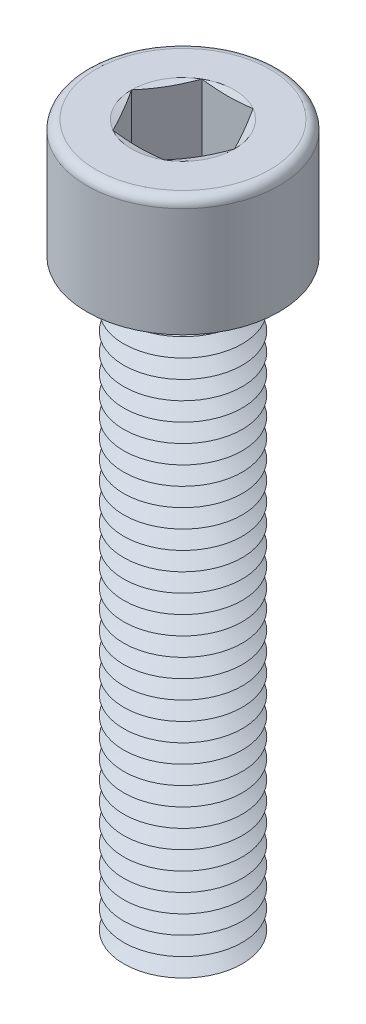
ISO-10303-21;
HEADER;
FILE_DESCRIPTION(('STEP AP214'),'2;1');
FILE_NAME('part.step','',(''),(''),'','','');
FILE_SCHEMA(('AUTOMOTIVE_DESIGN { 1 0 10303 214 1 1 1 1 }'));
ENDSEC;
DATA;
#1=APPLICATION_CONTEXT('core data for automotive mechanical design processes');
#2=APPLICATION_PROTOCOL_DEFINITION('international standard','automotive_design',2000,#1);
#3=PRODUCT_CONTEXT('',#1,'mechanical');
#4=PRODUCT('Part','Part','',(#3));
#5=PRODUCT_RELATED_PRODUCT_CATEGORY('part','',(#4));
#6=PRODUCT_DEFINITION_FORMATION('','',#4);
#7=PRODUCT_DEFINITION_CONTEXT('part definition',#1,'design');
#8=PRODUCT_DEFINITION('design','',#6,#7);
#9=PRODUCT_DEFINITION_SHAPE('','',#8);
#10=(LENGTH_UNIT() NAMED_UNIT(*) SI_UNIT(.MILLI.,.METRE.));
#11=(NAMED_UNIT(*) PLANE_ANGLE_UNIT() SI_UNIT($,.RADIAN.));
#12=(NAMED_UNIT(*) SI_UNIT($,.STERADIAN.) SOLID_ANGLE_UNIT());
#13=UNCERTAINTY_MEASURE_WITH_UNIT(LENGTH_MEASURE(1.E-05),#10,'distance_accuracy_value','');
#14=(GEOMETRIC_REPRESENTATION_CONTEXT(3) GLOBAL_UNCERTAINTY_ASSIGNED_CONTEXT((#13)) GLOBAL_UNIT_ASSIGNED_CONTEXT((#10,
#11,#12)) REPRESENTATION_CONTEXT('',''));
#15=CARTESIAN_POINT('',(0.,0.,0.));
#16=DIRECTION('',(0.,0.,1.));
#17=DIRECTION('',(1.,0.,0.));
#18=AXIS2_PLACEMENT_3D('',#15,#16,#17);
#19=CARTESIAN_POINT('',(0.,5.,0.));
#20=DIRECTION('',(0.,1.,0.));
#21=DIRECTION('',(0.,0.,1.));
#22=AXIS2_PLACEMENT_3D('',#19,#20,#21);
#23=CONICAL_SURFACE('',#22,2.91746824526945,1.0471975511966);
#24=CARTESIAN_POINT('',(0.,5.625,0.));
#25=DIRECTION('',(0.,1.,0.));
#26=DIRECTION('',(0.,0.,1.));
#27=AXIS2_PLACEMENT_3D('',#24,#25,#26);
#28=CIRCLE('',#27,4.);
#29=CARTESIAN_POINT('',(0.,5.625,4.));
#30=VERTEX_POINT('',#29);
#31=EDGE_CURVE('E566',#30,#30,#28,.T.);
#32=ORIENTED_EDGE('',*,*,#31,.F.);
#33=EDGE_LOOP('',(#32));
#34=FACE_BOUND('',#33,.T.);
#35=CARTESIAN_POINT('',(0.,5.,0.));
#36=DIRECTION('',(0.,1.,0.));
#37=DIRECTION('',(0.,0.,1.));
#38=AXIS2_PLACEMENT_3D('',#35,#36,#37);
#39=CIRCLE('',#38,2.91746824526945);
#40=CARTESIAN_POINT('',(0.,5.,2.91746824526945));
#41=VERTEX_POINT('',#40);
#42=EDGE_CURVE('E570',#41,#41,#39,.T.);
#43=ORIENTED_EDGE('',*,*,#42,.T.);
#44=EDGE_LOOP('',(#43));
#45=FACE_BOUND('',#44,.T.);
#46=ADVANCED_FACE('F41',(#34,#45),#23,.T.);
#47=CARTESIAN_POINT('',(0.,4.375,0.));
#48=DIRECTION('',(0.,-1.,0.));
#49=DIRECTION('',(0.,0.,-1.));
#50=AXIS2_PLACEMENT_3D('',#47,#48,#49);
#51=CONICAL_SURFACE('',#50,4.,1.0471975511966);
#52=ORIENTED_EDGE('',*,*,#42,.F.);
#53=EDGE_LOOP('',(#52));
#54=FACE_BOUND('',#53,.T.);
#55=CARTESIAN_POINT('',(0.,4.375,0.));
#56=DIRECTION('',(0.,1.,0.));
#57=DIRECTION('',(0.,0.,1.));
#58=AXIS2_PLACEMENT_3D('',#55,#56,#57);
#59=CIRCLE('',#58,4.);
#60=CARTESIAN_POINT('',(0.,4.375,4.));
#61=VERTEX_POINT('',#60);
#62=EDGE_CURVE('E574',#61,#61,#59,.T.);
#63=ORIENTED_EDGE('',*,*,#62,.T.);
#64=EDGE_LOOP('',(#63));
#65=FACE_BOUND('',#64,.T.);
#66=ADVANCED_FACE('F251',(#54,#65),#51,.T.);
#67=CARTESIAN_POINT('',(0.,0.,0.));
#68=DIRECTION('',(0.,1.,0.));
#69=DIRECTION('',(0.,0.,1.));
#70=AXIS2_PLACEMENT_3D('',#67,#68,#69);
#71=PLANE('',#70);
#72=CARTESIAN_POINT('',(0.,0.,0.));
#73=DIRECTION('',(0.,1.,0.));
#74=DIRECTION('',(0.,0.,1.));
#75=AXIS2_PLACEMENT_3D('',#72,#73,#74);
#76=CIRCLE('',#75,2.91746824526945);
#77=CARTESIAN_POINT('',(0.,0.,2.91746824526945));
#78=VERTEX_POINT('',#77);
#79=EDGE_CURVE('E602',#78,#78,#76,.T.);
#80=ORIENTED_EDGE('',*,*,#79,.F.);
#81=EDGE_LOOP('',(#80));
#82=FACE_BOUND('',#81,.T.);
#83=ADVANCED_FACE('F248',(#82),#71,.F.);
#84=CARTESIAN_POINT('',(0.,0.,0.));
#85=DIRECTION('',(0.,1.,0.));
#86=DIRECTION('',(0.,0.,1.));
#87=AXIS2_PLACEMENT_3D('',#84,#85,#86);
#88=CONICAL_SURFACE('',#87,2.91746824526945,1.0471975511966);
#89=CARTESIAN_POINT('',(0.,0.624999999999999,0.));
#90=DIRECTION('',(0.,1.,0.));
#91=DIRECTION('',(0.,0.,1.));
#92=AXIS2_PLACEMENT_3D('',#89,#90,#91);
#93=CIRCLE('',#92,4.);
#94=CARTESIAN_POINT('',(0.,0.624999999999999,4.));
#95=VERTEX_POINT('',#94);
#96=EDGE_CURVE('E598',#95,#95,#93,.T.);
#97=ORIENTED_EDGE('',*,*,#96,.F.);
#98=EDGE_LOOP('',(#97));
#99=FACE_BOUND('',#98,.T.);
#100=ORIENTED_EDGE('',*,*,#79,.T.);
#101=EDGE_LOOP('',(#100));
#102=FACE_BOUND('',#101,.T.);
#103=ADVANCED_FACE('F250',(#99,#102),#88,.T.);
#104=CARTESIAN_POINT('',(0.,0.624999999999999,0.));
#105=DIRECTION('',(0.,-1.,0.));
#106=DIRECTION('',(0.,0.,-1.));
#107=AXIS2_PLACEMENT_3D('',#104,#105,#106);
#108=CONICAL_SURFACE('',#107,4.,1.0471975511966);
#109=CARTESIAN_POINT('',(0.,1.25,0.));
#110=DIRECTION('',(0.,1.,0.));
#111=DIRECTION('',(0.,0.,1.));
#112=AXIS2_PLACEMENT_3D('',#109,#110,#111);
#113=CIRCLE('',#112,2.91746824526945);
#114=CARTESIAN_POINT('',(0.,1.25,2.91746824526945));
#115=VERTEX_POINT('',#114);
#116=EDGE_CURVE('E594',#115,#115,#113,.T.);
#117=ORIENTED_EDGE('',*,*,#116,.F.);
#118=EDGE_LOOP('',(#117));
#119=FACE_BOUND('',#118,.T.);
#120=ORIENTED_EDGE('',*,*,#96,.T.);
#121=EDGE_LOOP('',(#120));
#122=FACE_BOUND('',#121,.T.);
#123=ADVANCED_FACE('F291',(#119,#122),#108,.T.);
#124=CARTESIAN_POINT('',(0.,1.25,0.));
#125=DIRECTION('',(0.,1.,0.));
#126=DIRECTION('',(0.,0.,1.));
#127=AXIS2_PLACEMENT_3D('',#124,#125,#126);
#128=CONICAL_SURFACE('',#127,2.91746824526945,1.0471975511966);
#129=CARTESIAN_POINT('',(0.,1.875,0.));
#130=DIRECTION('',(0.,1.,0.));
#131=DIRECTION('',(0.,0.,1.));
#132=AXIS2_PLACEMENT_3D('',#129,#130,#131);
#133=CIRCLE('',#132,4.);
#134=CARTESIAN_POINT('',(0.,1.875,4.));
#135=VERTEX_POINT('',#134);
#136=EDGE_CURVE('E590',#135,#135,#133,.T.);
#137=ORIENTED_EDGE('',*,*,#136,.F.);
#138=EDGE_LOOP('',(#137));
#139=FACE_BOUND('',#138,.T.);
#140=ORIENTED_EDGE('',*,*,#116,.T.);
#141=EDGE_LOOP('',(#140));
#142=FACE_BOUND('',#141,.T.);
#143=ADVANCED_FACE('F286',(#139,#142),#128,.T.);
#144=CARTESIAN_POINT('',(0.,1.875,0.));
#145=DIRECTION('',(0.,-1.,0.));
#146=DIRECTION('',(0.,0.,-1.));
#147=AXIS2_PLACEMENT_3D('',#144,#145,#146);
#148=CONICAL_SURFACE('',#147,4.,1.0471975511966);
#149=CARTESIAN_POINT('',(0.,2.5,0.));
#150=DIRECTION('',(0.,1.,0.));
#151=DIRECTION('',(0.,0.,1.));
#152=AXIS2_PLACEMENT_3D('',#149,#150,#151);
#153=CIRCLE('',#152,2.91746824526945);
#154=CARTESIAN_POINT('',(0.,2.5,2.91746824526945));
#155=VERTEX_POINT('',#154);
#156=EDGE_CURVE('E586',#155,#155,#153,.T.);
#157=ORIENTED_EDGE('',*,*,#156,.F.);
#158=EDGE_LOOP('',(#157));
#159=FACE_BOUND('',#158,.T.);
#160=ORIENTED_EDGE('',*,*,#136,.T.);
#161=EDGE_LOOP('',(#160));
#162=FACE_BOUND('',#161,.T.);
#163=ADVANCED_FACE('F283',(#159,#162),#148,.T.);
#164=CARTESIAN_POINT('',(0.,2.5,0.));
#165=DIRECTION('',(0.,1.,0.));
#166=DIRECTION('',(0.,0.,1.));
#167=AXIS2_PLACEMENT_3D('',#164,#165,#166);
#168=CONICAL_SURFACE('',#167,2.91746824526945,1.0471975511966);
#169=CARTESIAN_POINT('',(0.,3.125,0.));
#170=DIRECTION('',(0.,1.,0.));
#171=DIRECTION('',(0.,0.,1.));
#172=AXIS2_PLACEMENT_3D('',#169,#170,#171);
#173=CIRCLE('',#172,4.);
#174=CARTESIAN_POINT('',(0.,3.125,4.));
#175=VERTEX_POINT('',#174);
#176=EDGE_CURVE('E582',#175,#175,#173,.T.);
#177=ORIENTED_EDGE('',*,*,#176,.F.);
#178=EDGE_LOOP('',(#177));
#179=FACE_BOUND('',#178,.T.);
#180=ORIENTED_EDGE('',*,*,#156,.T.);
#181=EDGE_LOOP('',(#180));
#182=FACE_BOUND('',#181,.T.);
#183=ADVANCED_FACE('F277',(#179,#182),#168,.T.);
#184=CARTESIAN_POINT('',(0.,3.125,0.));
#185=DIRECTION('',(0.,-1.,0.));
#186=DIRECTION('',(0.,0.,-1.));
#187=AXIS2_PLACEMENT_3D('',#184,#185,#186);
#188=CONICAL_SURFACE('',#187,4.,1.0471975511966);
#189=CARTESIAN_POINT('',(0.,3.75,0.));
#190=DIRECTION('',(0.,1.,0.));
#191=DIRECTION('',(0.,0.,1.));
#192=AXIS2_PLACEMENT_3D('',#189,#190,#191);
#193=CIRCLE('',#192,2.91746824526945);
#194=CARTESIAN_POINT('',(0.,3.75,2.91746824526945));
#195=VERTEX_POINT('',#194);
#196=EDGE_CURVE('E578',#195,#195,#193,.T.);
#197=ORIENTED_EDGE('',*,*,#196,.F.);
#198=EDGE_LOOP('',(#197));
#199=FACE_BOUND('',#198,.T.);
#200=ORIENTED_EDGE('',*,*,#176,.T.);
#201=EDGE_LOOP('',(#200));
#202=FACE_BOUND('',#201,.T.);
#203=ADVANCED_FACE('F273',(#199,#202),#188,.T.);
#204=CARTESIAN_POINT('',(0.,3.75,0.));
#205=DIRECTION('',(0.,1.,0.));
#206=DIRECTION('',(0.,0.,1.));
#207=AXIS2_PLACEMENT_3D('',#204,#205,#206);
#208=CONICAL_SURFACE('',#207,2.91746824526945,1.0471975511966);
#209=ORIENTED_EDGE('',*,*,#62,.F.);
#210=EDGE_LOOP('',(#209));
#211=FACE_BOUND('',#210,.T.);
#212=ORIENTED_EDGE('',*,*,#196,.T.);
#213=EDGE_LOOP('',(#212));
#214=FACE_BOUND('',#213,.T.);
#215=ADVANCED_FACE('F276',(#211,#214),#208,.T.);
#216=CARTESIAN_POINT('',(0.,6.25,0.));
#217=DIRECTION('',(0.,1.,0.));
#218=DIRECTION('',(0.,0.,1.));
#219=AXIS2_PLACEMENT_3D('',#216,#217,#218);
#220=CONICAL_SURFACE('',#219,2.91746824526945,1.0471975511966);
#221=CARTESIAN_POINT('',(0.,6.875,0.));
#222=DIRECTION('',(0.,1.,0.));
#223=DIRECTION('',(0.,0.,1.));
#224=AXIS2_PLACEMENT_3D('',#221,#222,#223);
#225=CIRCLE('',#224,4.);
#226=CARTESIAN_POINT('',(0.,6.875,4.));
#227=VERTEX_POINT('',#226);
#228=EDGE_CURVE('E558',#227,#227,#225,.T.);
#229=ORIENTED_EDGE('',*,*,#228,.F.);
#230=EDGE_LOOP('',(#229));
#231=FACE_BOUND('',#230,.T.);
#232=CARTESIAN_POINT('',(0.,6.25,0.));
#233=DIRECTION('',(0.,1.,0.));
#234=DIRECTION('',(0.,0.,1.));
#235=AXIS2_PLACEMENT_3D('',#232,#233,#234);
#236=CIRCLE('',#235,2.91746824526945);
#237=CARTESIAN_POINT('',(0.,6.25,2.91746824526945));
#238=VERTEX_POINT('',#237);
#239=EDGE_CURVE('E562',#238,#238,#236,.T.);
#240=ORIENTED_EDGE('',*,*,#239,.T.);
#241=EDGE_LOOP('',(#240));
#242=FACE_BOUND('',#241,.T.);
#243=ADVANCED_FACE('F281',(#231,#242),#220,.T.);
#244=CARTESIAN_POINT('',(0.,5.625,0.));
#245=DIRECTION('',(0.,-1.,0.));
#246=DIRECTION('',(0.,0.,-1.));
#247=AXIS2_PLACEMENT_3D('',#244,#245,#246);
#248=CONICAL_SURFACE('',#247,4.,1.0471975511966);
#249=ORIENTED_EDGE('',*,*,#239,.F.);
#250=EDGE_LOOP('',(#249));
#251=FACE_BOUND('',#250,.T.);
#252=ORIENTED_EDGE('',*,*,#31,.T.);
#253=EDGE_LOOP('',(#252));
#254=FACE_BOUND('',#253,.T.);
#255=ADVANCED_FACE('F840',(#251,#254),#248,.T.);
#256=CARTESIAN_POINT('',(0.,7.5,0.));
#257=DIRECTION('',(0.,1.,0.));
#258=DIRECTION('',(0.,0.,1.));
#259=AXIS2_PLACEMENT_3D('',#256,#257,#258);
#260=CONICAL_SURFACE('',#259,2.91746824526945,1.0471975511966);
#261=CARTESIAN_POINT('',(0.,8.125,0.));
#262=DIRECTION('',(0.,1.,0.));
#263=DIRECTION('',(0.,0.,1.));
#264=AXIS2_PLACEMENT_3D('',#261,#262,#263);
#265=CIRCLE('',#264,4.);
#266=CARTESIAN_POINT('',(0.,8.125,4.));
#267=VERTEX_POINT('',#266);
#268=EDGE_CURVE('E550',#267,#267,#265,.T.);
#269=ORIENTED_EDGE('',*,*,#268,.F.);
#270=EDGE_LOOP('',(#269));
#271=FACE_BOUND('',#270,.T.);
#272=CARTESIAN_POINT('',(0.,7.5,0.));
#273=DIRECTION('',(0.,1.,0.));
#274=DIRECTION('',(0.,0.,1.));
#275=AXIS2_PLACEMENT_3D('',#272,#273,#274);
#276=CIRCLE('',#275,2.91746824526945);
#277=CARTESIAN_POINT('',(0.,7.5,2.91746824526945));
#278=VERTEX_POINT('',#277);
#279=EDGE_CURVE('E554',#278,#278,#276,.T.);
#280=ORIENTED_EDGE('',*,*,#279,.T.);
#281=EDGE_LOOP('',(#280));
#282=FACE_BOUND('',#281,.T.);
#283=ADVANCED_FACE('F849',(#271,#282),#260,.T.);
#284=CARTESIAN_POINT('',(0.,6.875,0.));
#285=DIRECTION('',(0.,-1.,0.));
#286=DIRECTION('',(0.,0.,-1.));
#287=AXIS2_PLACEMENT_3D('',#284,#285,#286);
#288=CONICAL_SURFACE('',#287,4.,1.0471975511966);
#289=ORIENTED_EDGE('',*,*,#279,.F.);
#290=EDGE_LOOP('',(#289));
#291=FACE_BOUND('',#290,.T.);
#292=ORIENTED_EDGE('',*,*,#228,.T.);
#293=EDGE_LOOP('',(#292));
#294=FACE_BOUND('',#293,.T.);
#295=ADVANCED_FACE('F859',(#291,#294),#288,.T.);
#296=CARTESIAN_POINT('',(0.,8.75,0.));
#297=DIRECTION('',(0.,1.,0.));
#298=DIRECTION('',(0.,0.,1.));
#299=AXIS2_PLACEMENT_3D('',#296,#297,#298);
#300=CONICAL_SURFACE('',#299,2.91746824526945,1.0471975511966);
#301=CARTESIAN_POINT('',(0.,9.375,0.));
#302=DIRECTION('',(0.,1.,0.));
#303=DIRECTION('',(0.,0.,1.));
#304=AXIS2_PLACEMENT_3D('',#301,#302,#303);
#305=CIRCLE('',#304,4.);
#306=CARTESIAN_POINT('',(0.,9.375,4.));
#307=VERTEX_POINT('',#306);
#308=EDGE_CURVE('E542',#307,#307,#305,.T.);
#309=ORIENTED_EDGE('',*,*,#308,.F.);
#310=EDGE_LOOP('',(#309));
#311=FACE_BOUND('',#310,.T.);
#312=CARTESIAN_POINT('',(0.,8.75,0.));
#313=DIRECTION('',(0.,1.,0.));
#314=DIRECTION('',(0.,0.,1.));
#315=AXIS2_PLACEMENT_3D('',#312,#313,#314);
#316=CIRCLE('',#315,2.91746824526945);
#317=CARTESIAN_POINT('',(0.,8.75,2.91746824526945));
#318=VERTEX_POINT('',#317);
#319=EDGE_CURVE('E546',#318,#318,#316,.T.);
#320=ORIENTED_EDGE('',*,*,#319,.T.);
#321=EDGE_LOOP('',(#320));
#322=FACE_BOUND('',#321,.T.);
#323=ADVANCED_FACE('F869',(#311,#322),#300,.T.);
#324=CARTESIAN_POINT('',(0.,8.125,0.));
#325=DIRECTION('',(0.,-1.,0.));
#326=DIRECTION('',(0.,0.,-1.));
#327=AXIS2_PLACEMENT_3D('',#324,#325,#326);
#328=CONICAL_SURFACE('',#327,4.,1.0471975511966);
#329=ORIENTED_EDGE('',*,*,#319,.F.);
#330=EDGE_LOOP('',(#329));
#331=FACE_BOUND('',#330,.T.);
#332=ORIENTED_EDGE('',*,*,#268,.T.);
#333=EDGE_LOOP('',(#332));
#334=FACE_BOUND('',#333,.T.);
#335=ADVANCED_FACE('F879',(#331,#334),#328,.T.);
#336=CARTESIAN_POINT('',(0.,10.,0.));
#337=DIRECTION('',(0.,1.,0.));
#338=DIRECTION('',(0.,0.,1.));
#339=AXIS2_PLACEMENT_3D('',#336,#337,#338);
#340=CONICAL_SURFACE('',#339,2.91746824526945,1.0471975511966);
#341=CARTESIAN_POINT('',(0.,10.625,0.));
#342=DIRECTION('',(0.,1.,0.));
#343=DIRECTION('',(0.,0.,1.));
#344=AXIS2_PLACEMENT_3D('',#341,#342,#343);
#345=CIRCLE('',#344,4.);
#346=CARTESIAN_POINT('',(0.,10.625,4.));
#347=VERTEX_POINT('',#346);
#348=EDGE_CURVE('E534',#347,#347,#345,.T.);
#349=ORIENTED_EDGE('',*,*,#348,.F.);
#350=EDGE_LOOP('',(#349));
#351=FACE_BOUND('',#350,.T.);
#352=CARTESIAN_POINT('',(0.,10.,0.));
#353=DIRECTION('',(0.,1.,0.));
#354=DIRECTION('',(0.,0.,1.));
#355=AXIS2_PLACEMENT_3D('',#352,#353,#354);
#356=CIRCLE('',#355,2.91746824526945);
#357=CARTESIAN_POINT('',(0.,10.,2.91746824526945));
#358=VERTEX_POINT('',#357);
#359=EDGE_CURVE('E538',#358,#358,#356,.T.);
#360=ORIENTED_EDGE('',*,*,#359,.T.);
#361=EDGE_LOOP('',(#360));
#362=FACE_BOUND('',#361,.T.);
#363=ADVANCED_FACE('F889',(#351,#362),#340,.T.);
#364=CARTESIAN_POINT('',(0.,9.375,0.));
#365=DIRECTION('',(0.,-1.,0.));
#366=DIRECTION('',(0.,0.,-1.));
#367=AXIS2_PLACEMENT_3D('',#364,#365,#366);
#368=CONICAL_SURFACE('',#367,4.,1.0471975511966);
#369=ORIENTED_EDGE('',*,*,#359,.F.);
#370=EDGE_LOOP('',(#369));
#371=FACE_BOUND('',#370,.T.);
#372=ORIENTED_EDGE('',*,*,#308,.T.);
#373=EDGE_LOOP('',(#372));
#374=FACE_BOUND('',#373,.T.);
#375=ADVANCED_FACE('F899',(#371,#374),#368,.T.);
#376=CARTESIAN_POINT('',(0.,11.25,0.));
#377=DIRECTION('',(0.,1.,0.));
#378=DIRECTION('',(0.,0.,1.));
#379=AXIS2_PLACEMENT_3D('',#376,#377,#378);
#380=CONICAL_SURFACE('',#379,2.91746824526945,1.0471975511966);
#381=CARTESIAN_POINT('',(0.,11.875,0.));
#382=DIRECTION('',(0.,1.,0.));
#383=DIRECTION('',(0.,0.,1.));
#384=AXIS2_PLACEMENT_3D('',#381,#382,#383);
#385=CIRCLE('',#384,4.);
#386=CARTESIAN_POINT('',(0.,11.875,4.));
#387=VERTEX_POINT('',#386);
#388=EDGE_CURVE('E526',#387,#387,#385,.T.);
#389=ORIENTED_EDGE('',*,*,#388,.F.);
#390=EDGE_LOOP('',(#389));
#391=FACE_BOUND('',#390,.T.);
#392=CARTESIAN_POINT('',(0.,11.25,0.));
#393=DIRECTION('',(0.,1.,0.));
#394=DIRECTION('',(0.,0.,1.));
#395=AXIS2_PLACEMENT_3D('',#392,#393,#394);
#396=CIRCLE('',#395,2.91746824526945);
#397=CARTESIAN_POINT('',(0.,11.25,2.91746824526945));
#398=VERTEX_POINT('',#397);
#399=EDGE_CURVE('E530',#398,#398,#396,.T.);
#400=ORIENTED_EDGE('',*,*,#399,.T.);
#401=EDGE_LOOP('',(#400));
#402=FACE_BOUND('',#401,.T.);
#403=ADVANCED_FACE('F909',(#391,#402),#380,.T.);
#404=CARTESIAN_POINT('',(0.,10.625,0.));
#405=DIRECTION('',(0.,-1.,0.));
#406=DIRECTION('',(0.,0.,-1.));
#407=AXIS2_PLACEMENT_3D('',#404,#405,#406);
#408=CONICAL_SURFACE('',#407,4.,1.0471975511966);
#409=ORIENTED_EDGE('',*,*,#399,.F.);
#410=EDGE_LOOP('',(#409));
#411=FACE_BOUND('',#410,.T.);
#412=ORIENTED_EDGE('',*,*,#348,.T.);
#413=EDGE_LOOP('',(#412));
#414=FACE_BOUND('',#413,.T.);
#415=ADVANCED_FACE('F919',(#411,#414),#408,.T.);
#416=CARTESIAN_POINT('',(0.,12.5,0.));
#417=DIRECTION('',(0.,1.,0.));
#418=DIRECTION('',(0.,0.,1.));
#419=AXIS2_PLACEMENT_3D('',#416,#417,#418);
#420=CONICAL_SURFACE('',#419,2.91746824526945,1.0471975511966);
#421=CARTESIAN_POINT('',(0.,13.125,0.));
#422=DIRECTION('',(0.,1.,0.));
#423=DIRECTION('',(0.,0.,1.));
#424=AXIS2_PLACEMENT_3D('',#421,#422,#423);
#425=CIRCLE('',#424,4.);
#426=CARTESIAN_POINT('',(0.,13.125,4.));
#427=VERTEX_POINT('',#426);
#428=EDGE_CURVE('E518',#427,#427,#425,.T.);
#429=ORIENTED_EDGE('',*,*,#428,.F.);
#430=EDGE_LOOP('',(#429));
#431=FACE_BOUND('',#430,.T.);
#432=CARTESIAN_POINT('',(0.,12.5,0.));
#433=DIRECTION('',(0.,1.,0.));
#434=DIRECTION('',(0.,0.,1.));
#435=AXIS2_PLACEMENT_3D('',#432,#433,#434);
#436=CIRCLE('',#435,2.91746824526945);
#437=CARTESIAN_POINT('',(0.,12.5,2.91746824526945));
#438=VERTEX_POINT('',#437);
#439=EDGE_CURVE('E522',#438,#438,#436,.T.);
#440=ORIENTED_EDGE('',*,*,#439,.T.);
#441=EDGE_LOOP('',(#440));
#442=FACE_BOUND('',#441,.T.);
#443=ADVANCED_FACE('F929',(#431,#442),#420,.T.);
#444=CARTESIAN_POINT('',(0.,11.875,0.));
#445=DIRECTION('',(0.,-1.,0.));
#446=DIRECTION('',(0.,0.,-1.));
#447=AXIS2_PLACEMENT_3D('',#444,#445,#446);
#448=CONICAL_SURFACE('',#447,4.,1.0471975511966);
#449=ORIENTED_EDGE('',*,*,#439,.F.);
#450=EDGE_LOOP('',(#449));
#451=FACE_BOUND('',#450,.T.);
#452=ORIENTED_EDGE('',*,*,#388,.T.);
#453=EDGE_LOOP('',(#452));
#454=FACE_BOUND('',#453,.T.);
#455=ADVANCED_FACE('F939',(#451,#454),#448,.T.);
#456=CARTESIAN_POINT('',(0.,13.75,0.));
#457=DIRECTION('',(0.,1.,0.));
#458=DIRECTION('',(0.,0.,1.));
#459=AXIS2_PLACEMENT_3D('',#456,#457,#458);
#460=CONICAL_SURFACE('',#459,2.91746824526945,1.0471975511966);
#461=CARTESIAN_POINT('',(0.,14.375,0.));
#462=DIRECTION('',(0.,1.,0.));
#463=DIRECTION('',(0.,0.,1.));
#464=AXIS2_PLACEMENT_3D('',#461,#462,#463);
#465=CIRCLE('',#464,4.);
#466=CARTESIAN_POINT('',(0.,14.375,4.));
#467=VERTEX_POINT('',#466);
#468=EDGE_CURVE('E510',#467,#467,#465,.T.);
#469=ORIENTED_EDGE('',*,*,#468,.F.);
#470=EDGE_LOOP('',(#469));
#471=FACE_BOUND('',#470,.T.);
#472=CARTESIAN_POINT('',(0.,13.75,0.));
#473=DIRECTION('',(0.,1.,0.));
#474=DIRECTION('',(0.,0.,1.));
#475=AXIS2_PLACEMENT_3D('',#472,#473,#474);
#476=CIRCLE('',#475,2.91746824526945);
#477=CARTESIAN_POINT('',(0.,13.75,2.91746824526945));
#478=VERTEX_POINT('',#477);
#479=EDGE_CURVE('E514',#478,#478,#476,.T.);
#480=ORIENTED_EDGE('',*,*,#479,.T.);
#481=EDGE_LOOP('',(#480));
#482=FACE_BOUND('',#481,.T.);
#483=ADVANCED_FACE('F949',(#471,#482),#460,.T.);
#484=CARTESIAN_POINT('',(0.,13.125,0.));
#485=DIRECTION('',(0.,-1.,0.));
#486=DIRECTION('',(0.,0.,-1.));
#487=AXIS2_PLACEMENT_3D('',#484,#485,#486);
#488=CONICAL_SURFACE('',#487,4.,1.0471975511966);
#489=ORIENTED_EDGE('',*,*,#479,.F.);
#490=EDGE_LOOP('',(#489));
#491=FACE_BOUND('',#490,.T.);
#492=ORIENTED_EDGE('',*,*,#428,.T.);
#493=EDGE_LOOP('',(#492));
#494=FACE_BOUND('',#493,.T.);
#495=ADVANCED_FACE('F959',(#491,#494),#488,.T.);
#496=CARTESIAN_POINT('',(0.,15.,0.));
#497=DIRECTION('',(0.,1.,0.));
#498=DIRECTION('',(0.,0.,1.));
#499=AXIS2_PLACEMENT_3D('',#496,#497,#498);
#500=CONICAL_SURFACE('',#499,2.91746824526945,1.0471975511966);
#501=CARTESIAN_POINT('',(0.,15.625,0.));
#502=DIRECTION('',(0.,1.,0.));
#503=DIRECTION('',(0.,0.,1.));
#504=AXIS2_PLACEMENT_3D('',#501,#502,#503);
#505=CIRCLE('',#504,4.);
#506=CARTESIAN_POINT('',(0.,15.625,4.));
#507=VERTEX_POINT('',#506);
#508=EDGE_CURVE('E502',#507,#507,#505,.T.);
#509=ORIENTED_EDGE('',*,*,#508,.F.);
#510=EDGE_LOOP('',(#509));
#511=FACE_BOUND('',#510,.T.);
#512=CARTESIAN_POINT('',(0.,15.,0.));
#513=DIRECTION('',(0.,1.,0.));
#514=DIRECTION('',(0.,0.,1.));
#515=AXIS2_PLACEMENT_3D('',#512,#513,#514);
#516=CIRCLE('',#515,2.91746824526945);
#517=CARTESIAN_POINT('',(0.,15.,2.91746824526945));
#518=VERTEX_POINT('',#517);
#519=EDGE_CURVE('E506',#518,#518,#516,.T.);
#520=ORIENTED_EDGE('',*,*,#519,.T.);
#521=EDGE_LOOP('',(#520));
#522=FACE_BOUND('',#521,.T.);
#523=ADVANCED_FACE('F969',(#511,#522),#500,.T.);
#524=CARTESIAN_POINT('',(0.,14.375,0.));
#525=DIRECTION('',(0.,-1.,0.));
#526=DIRECTION('',(0.,0.,-1.));
#527=AXIS2_PLACEMENT_3D('',#524,#525,#526);
#528=CONICAL_SURFACE('',#527,4.,1.0471975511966);
#529=ORIENTED_EDGE('',*,*,#519,.F.);
#530=EDGE_LOOP('',(#529));
#531=FACE_BOUND('',#530,.T.);
#532=ORIENTED_EDGE('',*,*,#468,.T.);
#533=EDGE_LOOP('',(#532));
#534=FACE_BOUND('',#533,.T.);
#535=ADVANCED_FACE('F979',(#531,#534),#528,.T.);
#536=CARTESIAN_POINT('',(0.,16.25,0.));
#537=DIRECTION('',(0.,1.,0.));
#538=DIRECTION('',(0.,0.,1.));
#539=AXIS2_PLACEMENT_3D('',#536,#537,#538);
#540=CONICAL_SURFACE('',#539,2.91746824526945,1.0471975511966);
#541=CARTESIAN_POINT('',(0.,16.875,0.));
#542=DIRECTION('',(0.,1.,0.));
#543=DIRECTION('',(0.,0.,1.));
#544=AXIS2_PLACEMENT_3D('',#541,#542,#543);
#545=CIRCLE('',#544,4.);
#546=CARTESIAN_POINT('',(0.,16.875,4.));
#547=VERTEX_POINT('',#546);
#548=EDGE_CURVE('E494',#547,#547,#545,.T.);
#549=ORIENTED_EDGE('',*,*,#548,.F.);
#550=EDGE_LOOP('',(#549));
#551=FACE_BOUND('',#550,.T.);
#552=CARTESIAN_POINT('',(0.,16.25,0.));
#553=DIRECTION('',(0.,1.,0.));
#554=DIRECTION('',(0.,0.,1.));
#555=AXIS2_PLACEMENT_3D('',#552,#553,#554);
#556=CIRCLE('',#555,2.91746824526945);
#557=CARTESIAN_POINT('',(0.,16.25,2.91746824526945));
#558=VERTEX_POINT('',#557);
#559=EDGE_CURVE('E498',#558,#558,#556,.T.);
#560=ORIENTED_EDGE('',*,*,#559,.T.);
#561=EDGE_LOOP('',(#560));
#562=FACE_BOUND('',#561,.T.);
#563=ADVANCED_FACE('F989',(#551,#562),#540,.T.);
#564=CARTESIAN_POINT('',(0.,15.625,0.));
#565=DIRECTION('',(0.,-1.,0.));
#566=DIRECTION('',(0.,0.,-1.));
#567=AXIS2_PLACEMENT_3D('',#564,#565,#566);
#568=CONICAL_SURFACE('',#567,4.,1.0471975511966);
#569=ORIENTED_EDGE('',*,*,#559,.F.);
#570=EDGE_LOOP('',(#569));
#571=FACE_BOUND('',#570,.T.);
#572=ORIENTED_EDGE('',*,*,#508,.T.);
#573=EDGE_LOOP('',(#572));
#574=FACE_BOUND('',#573,.T.);
#575=ADVANCED_FACE('F999',(#571,#574),#568,.T.);
#576=CARTESIAN_POINT('',(0.,17.5,0.));
#577=DIRECTION('',(0.,1.,0.));
#578=DIRECTION('',(0.,0.,1.));
#579=AXIS2_PLACEMENT_3D('',#576,#577,#578);
#580=CONICAL_SURFACE('',#579,2.91746824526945,1.0471975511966);
#581=CARTESIAN_POINT('',(0.,18.125,0.));
#582=DIRECTION('',(0.,1.,0.));
#583=DIRECTION('',(0.,0.,1.));
#584=AXIS2_PLACEMENT_3D('',#581,#582,#583);
#585=CIRCLE('',#584,4.);
#586=CARTESIAN_POINT('',(0.,18.125,4.));
#587=VERTEX_POINT('',#586);
#588=EDGE_CURVE('E486',#587,#587,#585,.T.);
#589=ORIENTED_EDGE('',*,*,#588,.F.);
#590=EDGE_LOOP('',(#589));
#591=FACE_BOUND('',#590,.T.);
#592=CARTESIAN_POINT('',(0.,17.5,0.));
#593=DIRECTION('',(0.,1.,0.));
#594=DIRECTION('',(0.,0.,1.));
#595=AXIS2_PLACEMENT_3D('',#592,#593,#594);
#596=CIRCLE('',#595,2.91746824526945);
#597=CARTESIAN_POINT('',(0.,17.5,2.91746824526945));
#598=VERTEX_POINT('',#597);
#599=EDGE_CURVE('E490',#598,#598,#596,.T.);
#600=ORIENTED_EDGE('',*,*,#599,.T.);
#601=EDGE_LOOP('',(#600));
#602=FACE_BOUND('',#601,.T.);
#603=ADVANCED_FACE('F1009',(#591,#602),#580,.T.);
#604=CARTESIAN_POINT('',(0.,16.875,0.));
#605=DIRECTION('',(0.,-1.,0.));
#606=DIRECTION('',(0.,0.,-1.));
#607=AXIS2_PLACEMENT_3D('',#604,#605,#606);
#608=CONICAL_SURFACE('',#607,4.,1.0471975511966);
#609=ORIENTED_EDGE('',*,*,#599,.F.);
#610=EDGE_LOOP('',(#609));
#611=FACE_BOUND('',#610,.T.);
#612=ORIENTED_EDGE('',*,*,#548,.T.);
#613=EDGE_LOOP('',(#612));
#614=FACE_BOUND('',#613,.T.);
#615=ADVANCED_FACE('F1019',(#611,#614),#608,.T.);
#616=CARTESIAN_POINT('',(0.,18.75,0.));
#617=DIRECTION('',(0.,1.,0.));
#618=DIRECTION('',(0.,0.,1.));
#619=AXIS2_PLACEMENT_3D('',#616,#617,#618);
#620=CONICAL_SURFACE('',#619,2.91746824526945,1.0471975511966);
#621=CARTESIAN_POINT('',(0.,19.375,0.));
#622=DIRECTION('',(0.,1.,0.));
#623=DIRECTION('',(0.,0.,1.));
#624=AXIS2_PLACEMENT_3D('',#621,#622,#623);
#625=CIRCLE('',#624,4.);
#626=CARTESIAN_POINT('',(0.,19.375,4.));
#627=VERTEX_POINT('',#626);
#628=EDGE_CURVE('E478',#627,#627,#625,.T.);
#629=ORIENTED_EDGE('',*,*,#628,.F.);
#630=EDGE_LOOP('',(#629));
#631=FACE_BOUND('',#630,.T.);
#632=CARTESIAN_POINT('',(0.,18.75,0.));
#633=DIRECTION('',(0.,1.,0.));
#634=DIRECTION('',(0.,0.,1.));
#635=AXIS2_PLACEMENT_3D('',#632,#633,#634);
#636=CIRCLE('',#635,2.91746824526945);
#637=CARTESIAN_POINT('',(0.,18.75,2.91746824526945));
#638=VERTEX_POINT('',#637);
#639=EDGE_CURVE('E482',#638,#638,#636,.T.);
#640=ORIENTED_EDGE('',*,*,#639,.T.);
#641=EDGE_LOOP('',(#640));
#642=FACE_BOUND('',#641,.T.);
#643=ADVANCED_FACE('F1029',(#631,#642),#620,.T.);
#644=CARTESIAN_POINT('',(0.,18.125,0.));
#645=DIRECTION('',(0.,-1.,0.));
#646=DIRECTION('',(0.,0.,-1.));
#647=AXIS2_PLACEMENT_3D('',#644,#645,#646);
#648=CONICAL_SURFACE('',#647,4.,1.0471975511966);
#649=ORIENTED_EDGE('',*,*,#639,.F.);
#650=EDGE_LOOP('',(#649));
#651=FACE_BOUND('',#650,.T.);
#652=ORIENTED_EDGE('',*,*,#588,.T.);
#653=EDGE_LOOP('',(#652));
#654=FACE_BOUND('',#653,.T.);
#655=ADVANCED_FACE('F1039',(#651,#654),#648,.T.);
#656=CARTESIAN_POINT('',(0.,20.,0.));
#657=DIRECTION('',(0.,1.,0.));
#658=DIRECTION('',(0.,0.,1.));
#659=AXIS2_PLACEMENT_3D('',#656,#657,#658);
#660=CONICAL_SURFACE('',#659,2.91746824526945,1.0471975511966);
#661=CARTESIAN_POINT('',(0.,20.625,0.));
#662=DIRECTION('',(0.,1.,0.));
#663=DIRECTION('',(0.,0.,1.));
#664=AXIS2_PLACEMENT_3D('',#661,#662,#663);
#665=CIRCLE('',#664,4.);
#666=CARTESIAN_POINT('',(0.,20.625,4.));
#667=VERTEX_POINT('',#666);
#668=EDGE_CURVE('E470',#667,#667,#665,.T.);
#669=ORIENTED_EDGE('',*,*,#668,.F.);
#670=EDGE_LOOP('',(#669));
#671=FACE_BOUND('',#670,.T.);
#672=CARTESIAN_POINT('',(0.,20.,0.));
#673=DIRECTION('',(0.,1.,0.));
#674=DIRECTION('',(0.,0.,1.));
#675=AXIS2_PLACEMENT_3D('',#672,#673,#674);
#676=CIRCLE('',#675,2.91746824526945);
#677=CARTESIAN_POINT('',(0.,20.,2.91746824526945));
#678=VERTEX_POINT('',#677);
#679=EDGE_CURVE('E474',#678,#678,#676,.T.);
#680=ORIENTED_EDGE('',*,*,#679,.T.);
#681=EDGE_LOOP('',(#680));
#682=FACE_BOUND('',#681,.T.);
#683=ADVANCED_FACE('F1049',(#671,#682),#660,.T.);
#684=CARTESIAN_POINT('',(0.,19.375,0.));
#685=DIRECTION('',(0.,-1.,0.));
#686=DIRECTION('',(0.,0.,-1.));
#687=AXIS2_PLACEMENT_3D('',#684,#685,#686);
#688=CONICAL_SURFACE('',#687,4.,1.0471975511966);
#689=ORIENTED_EDGE('',*,*,#679,.F.);
#690=EDGE_LOOP('',(#689));
#691=FACE_BOUND('',#690,.T.);
#692=ORIENTED_EDGE('',*,*,#628,.T.);
#693=EDGE_LOOP('',(#692));
#694=FACE_BOUND('',#693,.T.);
#695=ADVANCED_FACE('F1059',(#691,#694),#688,.T.);
#696=CARTESIAN_POINT('',(0.,21.25,0.));
#697=DIRECTION('',(0.,1.,0.));
#698=DIRECTION('',(0.,0.,1.));
#699=AXIS2_PLACEMENT_3D('',#696,#697,#698);
#700=CONICAL_SURFACE('',#699,2.91746824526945,1.0471975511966);
#701=CARTESIAN_POINT('',(0.,21.875,0.));
#702=DIRECTION('',(0.,1.,0.));
#703=DIRECTION('',(0.,0.,1.));
#704=AXIS2_PLACEMENT_3D('',#701,#702,#703);
#705=CIRCLE('',#704,4.);
#706=CARTESIAN_POINT('',(0.,21.875,4.));
#707=VERTEX_POINT('',#706);
#708=EDGE_CURVE('E462',#707,#707,#705,.T.);
#709=ORIENTED_EDGE('',*,*,#708,.F.);
#710=EDGE_LOOP('',(#709));
#711=FACE_BOUND('',#710,.T.);
#712=CARTESIAN_POINT('',(0.,21.25,0.));
#713=DIRECTION('',(0.,1.,0.));
#714=DIRECTION('',(0.,0.,1.));
#715=AXIS2_PLACEMENT_3D('',#712,#713,#714);
#716=CIRCLE('',#715,2.91746824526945);
#717=CARTESIAN_POINT('',(0.,21.25,2.91746824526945));
#718=VERTEX_POINT('',#717);
#719=EDGE_CURVE('E466',#718,#718,#716,.T.);
#720=ORIENTED_EDGE('',*,*,#719,.T.);
#721=EDGE_LOOP('',(#720));
#722=FACE_BOUND('',#721,.T.);
#723=ADVANCED_FACE('F1069',(#711,#722),#700,.T.);
#724=CARTESIAN_POINT('',(0.,20.625,0.));
#725=DIRECTION('',(0.,-1.,0.));
#726=DIRECTION('',(0.,0.,-1.));
#727=AXIS2_PLACEMENT_3D('',#724,#725,#726);
#728=CONICAL_SURFACE('',#727,4.,1.0471975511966);
#729=ORIENTED_EDGE('',*,*,#719,.F.);
#730=EDGE_LOOP('',(#729));
#731=FACE_BOUND('',#730,.T.);
#732=ORIENTED_EDGE('',*,*,#668,.T.);
#733=EDGE_LOOP('',(#732));
#734=FACE_BOUND('',#733,.T.);
#735=ADVANCED_FACE('F1079',(#731,#734),#728,.T.);
#736=CARTESIAN_POINT('',(0.,22.5,0.));
#737=DIRECTION('',(0.,1.,0.));
#738=DIRECTION('',(0.,0.,1.));
#739=AXIS2_PLACEMENT_3D('',#736,#737,#738);
#740=CONICAL_SURFACE('',#739,2.91746824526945,1.0471975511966);
#741=CARTESIAN_POINT('',(0.,23.125,0.));
#742=DIRECTION('',(0.,1.,0.));
#743=DIRECTION('',(0.,0.,1.));
#744=AXIS2_PLACEMENT_3D('',#741,#742,#743);
#745=CIRCLE('',#744,4.);
#746=CARTESIAN_POINT('',(0.,23.125,4.));
#747=VERTEX_POINT('',#746);
#748=EDGE_CURVE('E454',#747,#747,#745,.T.);
#749=ORIENTED_EDGE('',*,*,#748,.F.);
#750=EDGE_LOOP('',(#749));
#751=FACE_BOUND('',#750,.T.);
#752=CARTESIAN_POINT('',(0.,22.5,0.));
#753=DIRECTION('',(0.,1.,0.));
#754=DIRECTION('',(0.,0.,1.));
#755=AXIS2_PLACEMENT_3D('',#752,#753,#754);
#756=CIRCLE('',#755,2.91746824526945);
#757=CARTESIAN_POINT('',(0.,22.5,2.91746824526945));
#758=VERTEX_POINT('',#757);
#759=EDGE_CURVE('E458',#758,#758,#756,.T.);
#760=ORIENTED_EDGE('',*,*,#759,.T.);
#761=EDGE_LOOP('',(#760));
#762=FACE_BOUND('',#761,.T.);
#763=ADVANCED_FACE('F1089',(#751,#762),#740,.T.);
#764=CARTESIAN_POINT('',(0.,21.875,0.));
#765=DIRECTION('',(0.,-1.,0.));
#766=DIRECTION('',(0.,0.,-1.));
#767=AXIS2_PLACEMENT_3D('',#764,#765,#766);
#768=CONICAL_SURFACE('',#767,4.,1.0471975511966);
#769=ORIENTED_EDGE('',*,*,#759,.F.);
#770=EDGE_LOOP('',(#769));
#771=FACE_BOUND('',#770,.T.);
#772=ORIENTED_EDGE('',*,*,#708,.T.);
#773=EDGE_LOOP('',(#772));
#774=FACE_BOUND('',#773,.T.);
#775=ADVANCED_FACE('F1099',(#771,#774),#768,.T.);
#776=CARTESIAN_POINT('',(0.,23.75,0.));
#777=DIRECTION('',(0.,1.,0.));
#778=DIRECTION('',(0.,0.,1.));
#779=AXIS2_PLACEMENT_3D('',#776,#777,#778);
#780=CONICAL_SURFACE('',#779,2.91746824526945,1.0471975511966);
#781=CARTESIAN_POINT('',(0.,24.375,0.));
#782=DIRECTION('',(0.,1.,0.));
#783=DIRECTION('',(0.,0.,1.));
#784=AXIS2_PLACEMENT_3D('',#781,#782,#783);
#785=CIRCLE('',#784,4.);
#786=CARTESIAN_POINT('',(0.,24.375,4.));
#787=VERTEX_POINT('',#786);
#788=EDGE_CURVE('E446',#787,#787,#785,.T.);
#789=ORIENTED_EDGE('',*,*,#788,.F.);
#790=EDGE_LOOP('',(#789));
#791=FACE_BOUND('',#790,.T.);
#792=CARTESIAN_POINT('',(0.,23.75,0.));
#793=DIRECTION('',(0.,1.,0.));
#794=DIRECTION('',(0.,0.,1.));
#795=AXIS2_PLACEMENT_3D('',#792,#793,#794);
#796=CIRCLE('',#795,2.91746824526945);
#797=CARTESIAN_POINT('',(0.,23.75,2.91746824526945));
#798=VERTEX_POINT('',#797);
#799=EDGE_CURVE('E450',#798,#798,#796,.T.);
#800=ORIENTED_EDGE('',*,*,#799,.T.);
#801=EDGE_LOOP('',(#800));
#802=FACE_BOUND('',#801,.T.);
#803=ADVANCED_FACE('F1109',(#791,#802),#780,.T.);
#804=CARTESIAN_POINT('',(0.,23.125,0.));
#805=DIRECTION('',(0.,-1.,0.));
#806=DIRECTION('',(0.,0.,-1.));
#807=AXIS2_PLACEMENT_3D('',#804,#805,#806);
#808=CONICAL_SURFACE('',#807,4.,1.0471975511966);
#809=ORIENTED_EDGE('',*,*,#799,.F.);
#810=EDGE_LOOP('',(#809));
#811=FACE_BOUND('',#810,.T.);
#812=ORIENTED_EDGE('',*,*,#748,.T.);
#813=EDGE_LOOP('',(#812));
#814=FACE_BOUND('',#813,.T.);
#815=ADVANCED_FACE('F1119',(#811,#814),#808,.T.);
#816=CARTESIAN_POINT('',(0.,25.,0.));
#817=DIRECTION('',(0.,1.,0.));
#818=DIRECTION('',(0.,0.,1.));
#819=AXIS2_PLACEMENT_3D('',#816,#817,#818);
#820=CONICAL_SURFACE('',#819,2.91746824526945,1.0471975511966);
#821=CARTESIAN_POINT('',(0.,25.625,0.));
#822=DIRECTION('',(0.,1.,0.));
#823=DIRECTION('',(0.,0.,1.));
#824=AXIS2_PLACEMENT_3D('',#821,#822,#823);
#825=CIRCLE('',#824,4.);
#826=CARTESIAN_POINT('',(0.,25.625,4.));
#827=VERTEX_POINT('',#826);
#828=EDGE_CURVE('E438',#827,#827,#825,.T.);
#829=ORIENTED_EDGE('',*,*,#828,.F.);
#830=EDGE_LOOP('',(#829));
#831=FACE_BOUND('',#830,.T.);
#832=CARTESIAN_POINT('',(0.,25.,0.));
#833=DIRECTION('',(0.,1.,0.));
#834=DIRECTION('',(0.,0.,1.));
#835=AXIS2_PLACEMENT_3D('',#832,#833,#834);
#836=CIRCLE('',#835,2.91746824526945);
#837=CARTESIAN_POINT('',(0.,25.,2.91746824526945));
#838=VERTEX_POINT('',#837);
#839=EDGE_CURVE('E442',#838,#838,#836,.T.);
#840=ORIENTED_EDGE('',*,*,#839,.T.);
#841=EDGE_LOOP('',(#840));
#842=FACE_BOUND('',#841,.T.);
#843=ADVANCED_FACE('F1129',(#831,#842),#820,.T.);
#844=CARTESIAN_POINT('',(0.,24.375,0.));
#845=DIRECTION('',(0.,-1.,0.));
#846=DIRECTION('',(0.,0.,-1.));
#847=AXIS2_PLACEMENT_3D('',#844,#845,#846);
#848=CONICAL_SURFACE('',#847,4.,1.0471975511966);
#849=ORIENTED_EDGE('',*,*,#839,.F.);
#850=EDGE_LOOP('',(#849));
#851=FACE_BOUND('',#850,.T.);
#852=ORIENTED_EDGE('',*,*,#788,.T.);
#853=EDGE_LOOP('',(#852));
#854=FACE_BOUND('',#853,.T.);
#855=ADVANCED_FACE('F1139',(#851,#854),#848,.T.);
#856=CARTESIAN_POINT('',(0.,26.25,0.));
#857=DIRECTION('',(0.,1.,0.));
#858=DIRECTION('',(0.,0.,1.));
#859=AXIS2_PLACEMENT_3D('',#856,#857,#858);
#860=CONICAL_SURFACE('',#859,2.91746824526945,1.0471975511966);
#861=CARTESIAN_POINT('',(0.,26.875,0.));
#862=DIRECTION('',(0.,1.,0.));
#863=DIRECTION('',(0.,0.,1.));
#864=AXIS2_PLACEMENT_3D('',#861,#862,#863);
#865=CIRCLE('',#864,4.);
#866=CARTESIAN_POINT('',(0.,26.875,4.));
#867=VERTEX_POINT('',#866);
#868=EDGE_CURVE('E430',#867,#867,#865,.T.);
#869=ORIENTED_EDGE('',*,*,#868,.F.);
#870=EDGE_LOOP('',(#869));
#871=FACE_BOUND('',#870,.T.);
#872=CARTESIAN_POINT('',(0.,26.25,0.));
#873=DIRECTION('',(0.,1.,0.));
#874=DIRECTION('',(0.,0.,1.));
#875=AXIS2_PLACEMENT_3D('',#872,#873,#874);
#876=CIRCLE('',#875,2.91746824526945);
#877=CARTESIAN_POINT('',(0.,26.25,2.91746824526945));
#878=VERTEX_POINT('',#877);
#879=EDGE_CURVE('E434',#878,#878,#876,.T.);
#880=ORIENTED_EDGE('',*,*,#879,.T.);
#881=EDGE_LOOP('',(#880));
#882=FACE_BOUND('',#881,.T.);
#883=ADVANCED_FACE('F1149',(#871,#882),#860,.T.);
#884=CARTESIAN_POINT('',(0.,25.625,0.));
#885=DIRECTION('',(0.,-1.,0.));
#886=DIRECTION('',(0.,0.,-1.));
#887=AXIS2_PLACEMENT_3D('',#884,#885,#886);
#888=CONICAL_SURFACE('',#887,4.,1.0471975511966);
#889=ORIENTED_EDGE('',*,*,#879,.F.);
#890=EDGE_LOOP('',(#889));
#891=FACE_BOUND('',#890,.T.);
#892=ORIENTED_EDGE('',*,*,#828,.T.);
#893=EDGE_LOOP('',(#892));
#894=FACE_BOUND('',#893,.T.);
#895=ADVANCED_FACE('F1159',(#891,#894),#888,.T.);
#896=CARTESIAN_POINT('',(0.,27.5,0.));
#897=DIRECTION('',(0.,1.,0.));
#898=DIRECTION('',(0.,0.,1.));
#899=AXIS2_PLACEMENT_3D('',#896,#897,#898);
#900=CONICAL_SURFACE('',#899,2.91746824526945,1.0471975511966);
#901=CARTESIAN_POINT('',(0.,28.125,0.));
#902=DIRECTION('',(0.,1.,0.));
#903=DIRECTION('',(0.,0.,1.));
#904=AXIS2_PLACEMENT_3D('',#901,#902,#903);
#905=CIRCLE('',#904,4.);
#906=CARTESIAN_POINT('',(0.,28.125,4.));
#907=VERTEX_POINT('',#906);
#908=EDGE_CURVE('E422',#907,#907,#905,.T.);
#909=ORIENTED_EDGE('',*,*,#908,.F.);
#910=EDGE_LOOP('',(#909));
#911=FACE_BOUND('',#910,.T.);
#912=CARTESIAN_POINT('',(0.,27.5,0.));
#913=DIRECTION('',(0.,1.,0.));
#914=DIRECTION('',(0.,0.,1.));
#915=AXIS2_PLACEMENT_3D('',#912,#913,#914);
#916=CIRCLE('',#915,2.91746824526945);
#917=CARTESIAN_POINT('',(0.,27.5,2.91746824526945));
#918=VERTEX_POINT('',#917);
#919=EDGE_CURVE('E426',#918,#918,#916,.T.);
#920=ORIENTED_EDGE('',*,*,#919,.T.);
#921=EDGE_LOOP('',(#920));
#922=FACE_BOUND('',#921,.T.);
#923=ADVANCED_FACE('F1169',(#911,#922),#900,.T.);
#924=CARTESIAN_POINT('',(0.,26.875,0.));
#925=DIRECTION('',(0.,-1.,0.));
#926=DIRECTION('',(0.,0.,-1.));
#927=AXIS2_PLACEMENT_3D('',#924,#925,#926);
#928=CONICAL_SURFACE('',#927,4.,1.0471975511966);
#929=ORIENTED_EDGE('',*,*,#919,.F.);
#930=EDGE_LOOP('',(#929));
#931=FACE_BOUND('',#930,.T.);
#932=ORIENTED_EDGE('',*,*,#868,.T.);
#933=EDGE_LOOP('',(#932));
#934=FACE_BOUND('',#933,.T.);
#935=ADVANCED_FACE('F1179',(#931,#934),#928,.T.);
#936=CARTESIAN_POINT('',(0.,28.75,0.));
#937=DIRECTION('',(0.,1.,0.));
#938=DIRECTION('',(0.,0.,1.));
#939=AXIS2_PLACEMENT_3D('',#936,#937,#938);
#940=CONICAL_SURFACE('',#939,2.91746824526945,1.0471975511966);
#941=CARTESIAN_POINT('',(0.,29.375,0.));
#942=DIRECTION('',(0.,1.,0.));
#943=DIRECTION('',(0.,0.,1.));
#944=AXIS2_PLACEMENT_3D('',#941,#942,#943);
#945=CIRCLE('',#944,4.);
#946=CARTESIAN_POINT('',(0.,29.375,4.));
#947=VERTEX_POINT('',#946);
#948=EDGE_CURVE('E414',#947,#947,#945,.T.);
#949=ORIENTED_EDGE('',*,*,#948,.F.);
#950=EDGE_LOOP('',(#949));
#951=FACE_BOUND('',#950,.T.);
#952=CARTESIAN_POINT('',(0.,28.75,0.));
#953=DIRECTION('',(0.,1.,0.));
#954=DIRECTION('',(0.,0.,1.));
#955=AXIS2_PLACEMENT_3D('',#952,#953,#954);
#956=CIRCLE('',#955,2.91746824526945);
#957=CARTESIAN_POINT('',(0.,28.75,2.91746824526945));
#958=VERTEX_POINT('',#957);
#959=EDGE_CURVE('E418',#958,#958,#956,.T.);
#960=ORIENTED_EDGE('',*,*,#959,.T.);
#961=EDGE_LOOP('',(#960));
#962=FACE_BOUND('',#961,.T.);
#963=ADVANCED_FACE('F1189',(#951,#962),#940,.T.);
#964=CARTESIAN_POINT('',(0.,28.125,0.));
#965=DIRECTION('',(0.,-1.,0.));
#966=DIRECTION('',(0.,0.,-1.));
#967=AXIS2_PLACEMENT_3D('',#964,#965,#966);
#968=CONICAL_SURFACE('',#967,4.,1.0471975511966);
#969=ORIENTED_EDGE('',*,*,#959,.F.);
#970=EDGE_LOOP('',(#969));
#971=FACE_BOUND('',#970,.T.);
#972=ORIENTED_EDGE('',*,*,#908,.T.);
#973=EDGE_LOOP('',(#972));
#974=FACE_BOUND('',#973,.T.);
#975=ADVANCED_FACE('F1199',(#971,#974),#968,.T.);
#976=CARTESIAN_POINT('',(0.,30.,0.));
#977=DIRECTION('',(0.,1.,0.));
#978=DIRECTION('',(0.,0.,1.));
#979=AXIS2_PLACEMENT_3D('',#976,#977,#978);
#980=CONICAL_SURFACE('',#979,2.91746824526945,1.0471975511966);
#981=CARTESIAN_POINT('',(0.,30.625,0.));
#982=DIRECTION('',(0.,1.,0.));
#983=DIRECTION('',(0.,0.,1.));
#984=AXIS2_PLACEMENT_3D('',#981,#982,#983);
#985=CIRCLE('',#984,4.);
#986=CARTESIAN_POINT('',(0.,30.625,4.));
#987=VERTEX_POINT('',#986);
#988=EDGE_CURVE('E406',#987,#987,#985,.T.);
#989=ORIENTED_EDGE('',*,*,#988,.F.);
#990=EDGE_LOOP('',(#989));
#991=FACE_BOUND('',#990,.T.);
#992=CARTESIAN_POINT('',(0.,30.,0.));
#993=DIRECTION('',(0.,1.,0.));
#994=DIRECTION('',(0.,0.,1.));
#995=AXIS2_PLACEMENT_3D('',#992,#993,#994);
#996=CIRCLE('',#995,2.91746824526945);
#997=CARTESIAN_POINT('',(0.,30.,2.91746824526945));
#998=VERTEX_POINT('',#997);
#999=EDGE_CURVE('E410',#998,#998,#996,.T.);
#1000=ORIENTED_EDGE('',*,*,#999,.T.);
#1001=EDGE_LOOP('',(#1000));
#1002=FACE_BOUND('',#1001,.T.);
#1003=ADVANCED_FACE('F1209',(#991,#1002),#980,.T.);
#1004=CARTESIAN_POINT('',(0.,29.375,0.));
#1005=DIRECTION('',(0.,-1.,0.));
#1006=DIRECTION('',(0.,0.,-1.));
#1007=AXIS2_PLACEMENT_3D('',#1004,#1005,#1006);
#1008=CONICAL_SURFACE('',#1007,4.,1.0471975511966);
#1009=ORIENTED_EDGE('',*,*,#999,.F.);
#1010=EDGE_LOOP('',(#1009));
#1011=FACE_BOUND('',#1010,.T.);
#1012=ORIENTED_EDGE('',*,*,#948,.T.);
#1013=EDGE_LOOP('',(#1012));
#1014=FACE_BOUND('',#1013,.T.);
#1015=ADVANCED_FACE('F1219',(#1011,#1014),#1008,.T.);
#1016=CARTESIAN_POINT('',(0.,31.25,0.));
#1017=DIRECTION('',(0.,1.,0.));
#1018=DIRECTION('',(0.,0.,1.));
#1019=AXIS2_PLACEMENT_3D('',#1016,#1017,#1018);
#1020=CONICAL_SURFACE('',#1019,2.91746824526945,1.0471975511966);
#1021=CARTESIAN_POINT('',(0.,31.875,0.));
#1022=DIRECTION('',(0.,1.,0.));
#1023=DIRECTION('',(0.,0.,1.));
#1024=AXIS2_PLACEMENT_3D('',#1021,#1022,#1023);
#1025=CIRCLE('',#1024,4.);
#1026=CARTESIAN_POINT('',(0.,31.875,4.));
#1027=VERTEX_POINT('',#1026);
#1028=EDGE_CURVE('E398',#1027,#1027,#1025,.T.);
#1029=ORIENTED_EDGE('',*,*,#1028,.F.);
#1030=EDGE_LOOP('',(#1029));
#1031=FACE_BOUND('',#1030,.T.);
#1032=CARTESIAN_POINT('',(0.,31.25,0.));
#1033=DIRECTION('',(0.,1.,0.));
#1034=DIRECTION('',(0.,0.,1.));
#1035=AXIS2_PLACEMENT_3D('',#1032,#1033,#1034);
#1036=CIRCLE('',#1035,2.91746824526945);
#1037=CARTESIAN_POINT('',(0.,31.25,2.91746824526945));
#1038=VERTEX_POINT('',#1037);
#1039=EDGE_CURVE('E402',#1038,#1038,#1036,.T.);
#1040=ORIENTED_EDGE('',*,*,#1039,.T.);
#1041=EDGE_LOOP('',(#1040));
#1042=FACE_BOUND('',#1041,.T.);
#1043=ADVANCED_FACE('F1229',(#1031,#1042),#1020,.T.);
#1044=CARTESIAN_POINT('',(0.,30.625,0.));
#1045=DIRECTION('',(0.,-1.,0.));
#1046=DIRECTION('',(0.,0.,-1.));
#1047=AXIS2_PLACEMENT_3D('',#1044,#1045,#1046);
#1048=CONICAL_SURFACE('',#1047,4.,1.0471975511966);
#1049=ORIENTED_EDGE('',*,*,#1039,.F.);
#1050=EDGE_LOOP('',(#1049));
#1051=FACE_BOUND('',#1050,.T.);
#1052=ORIENTED_EDGE('',*,*,#988,.T.);
#1053=EDGE_LOOP('',(#1052));
#1054=FACE_BOUND('',#1053,.T.);
#1055=ADVANCED_FACE('F1239',(#1051,#1054),#1048,.T.);
#1056=CARTESIAN_POINT('',(0.,32.5,0.));
#1057=DIRECTION('',(0.,1.,0.));
#1058=DIRECTION('',(0.,0.,1.));
#1059=AXIS2_PLACEMENT_3D('',#1056,#1057,#1058);
#1060=CONICAL_SURFACE('',#1059,2.91746824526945,1.0471975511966);
#1061=CARTESIAN_POINT('',(0.,33.125,0.));
#1062=DIRECTION('',(0.,1.,0.));
#1063=DIRECTION('',(0.,0.,1.));
#1064=AXIS2_PLACEMENT_3D('',#1061,#1062,#1063);
#1065=CIRCLE('',#1064,4.);
#1066=CARTESIAN_POINT('',(0.,33.125,4.));
#1067=VERTEX_POINT('',#1066);
#1068=EDGE_CURVE('E390',#1067,#1067,#1065,.T.);
#1069=ORIENTED_EDGE('',*,*,#1068,.F.);
#1070=EDGE_LOOP('',(#1069));
#1071=FACE_BOUND('',#1070,.T.);
#1072=CARTESIAN_POINT('',(0.,32.5,0.));
#1073=DIRECTION('',(0.,1.,0.));
#1074=DIRECTION('',(0.,0.,1.));
#1075=AXIS2_PLACEMENT_3D('',#1072,#1073,#1074);
#1076=CIRCLE('',#1075,2.91746824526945);
#1077=CARTESIAN_POINT('',(0.,32.5,2.91746824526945));
#1078=VERTEX_POINT('',#1077);
#1079=EDGE_CURVE('E394',#1078,#1078,#1076,.T.);
#1080=ORIENTED_EDGE('',*,*,#1079,.T.);
#1081=EDGE_LOOP('',(#1080));
#1082=FACE_BOUND('',#1081,.T.);
#1083=ADVANCED_FACE('F1249',(#1071,#1082),#1060,.T.);
#1084=CARTESIAN_POINT('',(0.,31.875,0.));
#1085=DIRECTION('',(0.,-1.,0.));
#1086=DIRECTION('',(0.,0.,-1.));
#1087=AXIS2_PLACEMENT_3D('',#1084,#1085,#1086);
#1088=CONICAL_SURFACE('',#1087,4.,1.0471975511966);
#1089=ORIENTED_EDGE('',*,*,#1079,.F.);
#1090=EDGE_LOOP('',(#1089));
#1091=FACE_BOUND('',#1090,.T.);
#1092=ORIENTED_EDGE('',*,*,#1028,.T.);
#1093=EDGE_LOOP('',(#1092));
#1094=FACE_BOUND('',#1093,.T.);
#1095=ADVANCED_FACE('F1259',(#1091,#1094),#1088,.T.);
#1096=CARTESIAN_POINT('',(0.,33.75,0.));
#1097=DIRECTION('',(0.,1.,0.));
#1098=DIRECTION('',(0.,0.,1.));
#1099=AXIS2_PLACEMENT_3D('',#1096,#1097,#1098);
#1100=CONICAL_SURFACE('',#1099,2.91746824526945,1.0471975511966);
#1101=CARTESIAN_POINT('',(0.,34.375,0.));
#1102=DIRECTION('',(0.,1.,0.));
#1103=DIRECTION('',(0.,0.,1.));
#1104=AXIS2_PLACEMENT_3D('',#1101,#1102,#1103);
#1105=CIRCLE('',#1104,4.);
#1106=CARTESIAN_POINT('',(0.,34.375,4.));
#1107=VERTEX_POINT('',#1106);
#1108=EDGE_CURVE('E382',#1107,#1107,#1105,.T.);
#1109=ORIENTED_EDGE('',*,*,#1108,.F.);
#1110=EDGE_LOOP('',(#1109));
#1111=FACE_BOUND('',#1110,.T.);
#1112=CARTESIAN_POINT('',(0.,33.75,0.));
#1113=DIRECTION('',(0.,1.,0.));
#1114=DIRECTION('',(0.,0.,1.));
#1115=AXIS2_PLACEMENT_3D('',#1112,#1113,#1114);
#1116=CIRCLE('',#1115,2.91746824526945);
#1117=CARTESIAN_POINT('',(0.,33.75,2.91746824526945));
#1118=VERTEX_POINT('',#1117);
#1119=EDGE_CURVE('E386',#1118,#1118,#1116,.T.);
#1120=ORIENTED_EDGE('',*,*,#1119,.T.);
#1121=EDGE_LOOP('',(#1120));
#1122=FACE_BOUND('',#1121,.T.);
#1123=ADVANCED_FACE('F1269',(#1111,#1122),#1100,.T.);
#1124=CARTESIAN_POINT('',(0.,33.125,0.));
#1125=DIRECTION('',(0.,-1.,0.));
#1126=DIRECTION('',(0.,0.,-1.));
#1127=AXIS2_PLACEMENT_3D('',#1124,#1125,#1126);
#1128=CONICAL_SURFACE('',#1127,4.,1.0471975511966);
#1129=ORIENTED_EDGE('',*,*,#1119,.F.);
#1130=EDGE_LOOP('',(#1129));
#1131=FACE_BOUND('',#1130,.T.);
#1132=ORIENTED_EDGE('',*,*,#1068,.T.);
#1133=EDGE_LOOP('',(#1132));
#1134=FACE_BOUND('',#1133,.T.);
#1135=ADVANCED_FACE('F1279',(#1131,#1134),#1128,.T.);
#1136=CARTESIAN_POINT('',(0.,35.,0.));
#1137=DIRECTION('',(0.,1.,0.));
#1138=DIRECTION('',(0.,0.,1.));
#1139=AXIS2_PLACEMENT_3D('',#1136,#1137,#1138);
#1140=CONICAL_SURFACE('',#1139,2.91746824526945,1.0471975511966);
#1141=CARTESIAN_POINT('',(0.,35.625,0.));
#1142=DIRECTION('',(0.,1.,0.));
#1143=DIRECTION('',(0.,0.,1.));
#1144=AXIS2_PLACEMENT_3D('',#1141,#1142,#1143);
#1145=CIRCLE('',#1144,4.);
#1146=CARTESIAN_POINT('',(0.,35.625,4.));
#1147=VERTEX_POINT('',#1146);
#1148=EDGE_CURVE('E374',#1147,#1147,#1145,.T.);
#1149=ORIENTED_EDGE('',*,*,#1148,.F.);
#1150=EDGE_LOOP('',(#1149));
#1151=FACE_BOUND('',#1150,.T.);
#1152=CARTESIAN_POINT('',(0.,35.,0.));
#1153=DIRECTION('',(0.,1.,0.));
#1154=DIRECTION('',(0.,0.,1.));
#1155=AXIS2_PLACEMENT_3D('',#1152,#1153,#1154);
#1156=CIRCLE('',#1155,2.91746824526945);
#1157=CARTESIAN_POINT('',(0.,35.,2.91746824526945));
#1158=VERTEX_POINT('',#1157);
#1159=EDGE_CURVE('E378',#1158,#1158,#1156,.T.);
#1160=ORIENTED_EDGE('',*,*,#1159,.T.);
#1161=EDGE_LOOP('',(#1160));
#1162=FACE_BOUND('',#1161,.T.);
#1163=ADVANCED_FACE('F1289',(#1151,#1162),#1140,.T.);
#1164=CARTESIAN_POINT('',(0.,34.375,0.));
#1165=DIRECTION('',(0.,-1.,0.));
#1166=DIRECTION('',(0.,0.,-1.));
#1167=AXIS2_PLACEMENT_3D('',#1164,#1165,#1166);
#1168=CONICAL_SURFACE('',#1167,4.,1.0471975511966);
#1169=ORIENTED_EDGE('',*,*,#1159,.F.);
#1170=EDGE_LOOP('',(#1169));
#1171=FACE_BOUND('',#1170,.T.);
#1172=ORIENTED_EDGE('',*,*,#1108,.T.);
#1173=EDGE_LOOP('',(#1172));
#1174=FACE_BOUND('',#1173,.T.);
#1175=ADVANCED_FACE('F1299',(#1171,#1174),#1168,.T.);
#1176=CARTESIAN_POINT('',(0.,36.25,0.));
#1177=DIRECTION('',(0.,1.,0.));
#1178=DIRECTION('',(0.,0.,1.));
#1179=AXIS2_PLACEMENT_3D('',#1176,#1177,#1178);
#1180=CONICAL_SURFACE('',#1179,2.91746824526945,1.0471975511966);
#1181=CARTESIAN_POINT('',(0.,36.875,0.));
#1182=DIRECTION('',(0.,1.,0.));
#1183=DIRECTION('',(0.,0.,1.));
#1184=AXIS2_PLACEMENT_3D('',#1181,#1182,#1183);
#1185=CIRCLE('',#1184,4.);
#1186=CARTESIAN_POINT('',(0.,36.875,4.));
#1187=VERTEX_POINT('',#1186);
#1188=EDGE_CURVE('E367',#1187,#1187,#1185,.T.);
#1189=ORIENTED_EDGE('',*,*,#1188,.F.);
#1190=EDGE_LOOP('',(#1189));
#1191=FACE_BOUND('',#1190,.T.);
#1192=CARTESIAN_POINT('',(0.,36.25,0.));
#1193=DIRECTION('',(0.,1.,0.));
#1194=DIRECTION('',(0.,0.,1.));
#1195=AXIS2_PLACEMENT_3D('',#1192,#1193,#1194);
#1196=CIRCLE('',#1195,2.91746824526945);
#1197=CARTESIAN_POINT('',(0.,36.25,2.91746824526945));
#1198=VERTEX_POINT('',#1197);
#1199=EDGE_CURVE('E370',#1198,#1198,#1196,.T.);
#1200=ORIENTED_EDGE('',*,*,#1199,.T.);
#1201=EDGE_LOOP('',(#1200));
#1202=FACE_BOUND('',#1201,.T.);
#1203=ADVANCED_FACE('F1309',(#1191,#1202),#1180,.T.);
#1204=CARTESIAN_POINT('',(0.,35.625,0.));
#1205=DIRECTION('',(0.,-1.,0.));
#1206=DIRECTION('',(0.,0.,-1.));
#1207=AXIS2_PLACEMENT_3D('',#1204,#1205,#1206);
#1208=CONICAL_SURFACE('',#1207,4.,1.0471975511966);
#1209=ORIENTED_EDGE('',*,*,#1199,.F.);
#1210=EDGE_LOOP('',(#1209));
#1211=FACE_BOUND('',#1210,.T.);
#1212=ORIENTED_EDGE('',*,*,#1148,.T.);
#1213=EDGE_LOOP('',(#1212));
#1214=FACE_BOUND('',#1213,.T.);
#1215=ADVANCED_FACE('F1319',(#1211,#1214),#1208,.T.);
#1216=CARTESIAN_POINT('',(0.,37.5,0.));
#1217=DIRECTION('',(0.,1.,0.));
#1218=DIRECTION('',(0.,0.,1.));
#1219=AXIS2_PLACEMENT_3D('',#1216,#1217,#1218);
#1220=CONICAL_SURFACE('',#1219,2.91746824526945,1.0471975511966);
#1221=CARTESIAN_POINT('',(0.,38.125,0.));
#1222=DIRECTION('',(0.,1.,0.));
#1223=DIRECTION('',(0.,0.,1.));
#1224=AXIS2_PLACEMENT_3D('',#1221,#1222,#1223);
#1225=CIRCLE('',#1224,4.);
#1226=CARTESIAN_POINT('',(0.,38.125,4.));
#1227=VERTEX_POINT('',#1226);
#1228=EDGE_CURVE('E352',#1227,#1227,#1225,.T.);
#1229=ORIENTED_EDGE('',*,*,#1228,.F.);
#1230=EDGE_LOOP('',(#1229));
#1231=FACE_BOUND('',#1230,.T.);
#1232=CARTESIAN_POINT('',(0.,37.5,0.));
#1233=DIRECTION('',(0.,1.,0.));
#1234=DIRECTION('',(0.,0.,1.));
#1235=AXIS2_PLACEMENT_3D('',#1232,#1233,#1234);
#1236=CIRCLE('',#1235,2.91746824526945);
#1237=CARTESIAN_POINT('',(0.,37.5,2.91746824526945));
#1238=VERTEX_POINT('',#1237);
#1239=EDGE_CURVE('E363',#1238,#1238,#1236,.T.);
#1240=ORIENTED_EDGE('',*,*,#1239,.T.);
#1241=EDGE_LOOP('',(#1240));
#1242=FACE_BOUND('',#1241,.T.);
#1243=ADVANCED_FACE('F1329',(#1231,#1242),#1220,.T.);
#1244=CARTESIAN_POINT('',(0.,36.875,0.));
#1245=DIRECTION('',(0.,-1.,0.));
#1246=DIRECTION('',(0.,0.,-1.));
#1247=AXIS2_PLACEMENT_3D('',#1244,#1245,#1246);
#1248=CONICAL_SURFACE('',#1247,4.,1.0471975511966);
#1249=ORIENTED_EDGE('',*,*,#1239,.F.);
#1250=EDGE_LOOP('',(#1249));
#1251=FACE_BOUND('',#1250,.T.);
#1252=ORIENTED_EDGE('',*,*,#1188,.T.);
#1253=EDGE_LOOP('',(#1252));
#1254=FACE_BOUND('',#1253,.T.);
#1255=ADVANCED_FACE('F1339',(#1251,#1254),#1248,.T.);
#1256=CARTESIAN_POINT('',(0.,38.75,0.));
#1257=DIRECTION('',(0.,1.,0.));
#1258=DIRECTION('',(0.,0.,1.));
#1259=AXIS2_PLACEMENT_3D('',#1256,#1257,#1258);
#1260=CONICAL_SURFACE('',#1259,2.91746824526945,1.0471975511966);
#1261=CARTESIAN_POINT('',(0.,39.375,0.));
#1262=DIRECTION('',(0.,1.,0.));
#1263=DIRECTION('',(0.,0.,1.));
#1264=AXIS2_PLACEMENT_3D('',#1261,#1262,#1263);
#1265=CIRCLE('',#1264,4.);
#1266=CARTESIAN_POINT('',(0.,39.375,4.));
#1267=VERTEX_POINT('',#1266);
#1268=EDGE_CURVE('E358',#1267,#1267,#1265,.T.);
#1269=ORIENTED_EDGE('',*,*,#1268,.F.);
#1270=EDGE_LOOP('',(#1269));
#1271=FACE_BOUND('',#1270,.T.);
#1272=CARTESIAN_POINT('',(0.,38.75,0.));
#1273=DIRECTION('',(0.,1.,0.));
#1274=DIRECTION('',(0.,0.,1.));
#1275=AXIS2_PLACEMENT_3D('',#1272,#1273,#1274);
#1276=CIRCLE('',#1275,2.91746824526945);
#1277=CARTESIAN_POINT('',(0.,38.75,2.91746824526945));
#1278=VERTEX_POINT('',#1277);
#1279=EDGE_CURVE('E348',#1278,#1278,#1276,.T.);
#1280=ORIENTED_EDGE('',*,*,#1279,.T.);
#1281=EDGE_LOOP('',(#1280));
#1282=FACE_BOUND('',#1281,.T.);
#1283=ADVANCED_FACE('F1349',(#1271,#1282),#1260,.T.);
#1284=CARTESIAN_POINT('',(0.,38.125,0.));
#1285=DIRECTION('',(0.,-1.,0.));
#1286=DIRECTION('',(0.,0.,-1.));
#1287=AXIS2_PLACEMENT_3D('',#1284,#1285,#1286);
#1288=CONICAL_SURFACE('',#1287,4.,1.0471975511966);
#1289=ORIENTED_EDGE('',*,*,#1279,.F.);
#1290=EDGE_LOOP('',(#1289));
#1291=FACE_BOUND('',#1290,.T.);
#1292=ORIENTED_EDGE('',*,*,#1228,.T.);
#1293=EDGE_LOOP('',(#1292));
#1294=FACE_BOUND('',#1293,.T.);
#1295=ADVANCED_FACE('F195',(#1291,#1294),#1288,.T.);
#1296=CARTESIAN_POINT('',(0.,48.,0.));
#1297=DIRECTION('',(0.,1.,0.));
#1298=DIRECTION('',(0.,0.,1.));
#1299=AXIS2_PLACEMENT_3D('',#1296,#1297,#1298);
#1300=PLANE('',#1299);
#1301=CARTESIAN_POINT('',(0.,48.,0.));
#1302=DIRECTION('',(0.,1.,0.));
#1303=DIRECTION('',(0.,0.,1.));
#1304=AXIS2_PLACEMENT_3D('',#1301,#1302,#1303);
#1305=CIRCLE('',#1304,3.46410161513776);
#1306=CARTESIAN_POINT('',(1.73205080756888,48.,3.));
#1307=VERTEX_POINT('',#1306);
#1308=CARTESIAN_POINT('',(3.46410161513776,48.,0.));
#1309=VERTEX_POINT('',#1308);
#1310=EDGE_CURVE('E121',#1307,#1309,#1305,.T.);
#1311=ORIENTED_EDGE('',*,*,#1310,.F.);
#1312=CARTESIAN_POINT('',(0.,48.,0.));
#1313=DIRECTION('',(0.,1.,0.));
#1314=DIRECTION('',(0.,0.,1.));
#1315=AXIS2_PLACEMENT_3D('',#1312,#1313,#1314);
#1316=CIRCLE('',#1315,3.46410161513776);
#1317=CARTESIAN_POINT('',(-1.73205080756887,48.,3.));
#1318=VERTEX_POINT('',#1317);
#1319=EDGE_CURVE('E45',#1318,#1307,#1316,.T.);
#1320=ORIENTED_EDGE('',*,*,#1319,.F.);
#1321=CARTESIAN_POINT('',(-3.46410161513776,48.,0.));
#1322=VERTEX_POINT('',#1321);
#1323=EDGE_CURVE('E138',#1322,#1318,#1316,.T.);
#1324=ORIENTED_EDGE('',*,*,#1323,.F.);
#1325=CARTESIAN_POINT('',(-1.73205080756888,48.,-3.));
#1326=VERTEX_POINT('',#1325);
#1327=EDGE_CURVE('E674',#1326,#1322,#1316,.T.);
#1328=ORIENTED_EDGE('',*,*,#1327,.F.);
#1329=CARTESIAN_POINT('',(1.73205080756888,48.,-3.));
#1330=VERTEX_POINT('',#1329);
#1331=EDGE_CURVE('E51',#1330,#1326,#1316,.T.);
#1332=ORIENTED_EDGE('',*,*,#1331,.F.);
#1333=EDGE_CURVE('E11',#1309,#1330,#1316,.T.);
#1334=ORIENTED_EDGE('',*,*,#1333,.F.);
#1335=EDGE_LOOP('',(#1311,#1320,#1324,#1328,#1332,#1334));
#1336=FACE_BOUND('',#1335,.T.);
#1337=CARTESIAN_POINT('',(0.,48.,0.));
#1338=DIRECTION('',(0.,1.,0.));
#1339=DIRECTION('',(0.,0.,1.));
#1340=AXIS2_PLACEMENT_3D('',#1337,#1338,#1339);
#1341=CIRCLE('',#1340,5.875);
#1342=CARTESIAN_POINT('',(0.,48.,5.875));
#1343=VERTEX_POINT('',#1342);
#1344=EDGE_CURVE('E646',#1343,#1343,#1341,.T.);
#1345=ORIENTED_EDGE('',*,*,#1344,.T.);
#1346=EDGE_LOOP('',(#1345));
#1347=FACE_BOUND('',#1346,.T.);
#1348=ADVANCED_FACE('F140',(#1336,#1347),#1300,.T.);
#1349=CARTESIAN_POINT('',(0.,47.375,0.));
#1350=DIRECTION('',(0.,1.,0.));
#1351=DIRECTION('',(0.,0.,1.));
#1352=AXIS2_PLACEMENT_3D('',#1349,#1350,#1351);
#1353=TOROIDAL_SURFACE('',#1352,5.875,0.625);
#1354=CARTESIAN_POINT('',(0.,47.375,0.));
#1355=DIRECTION('',(0.,1.,0.));
#1356=DIRECTION('',(0.,0.,1.));
#1357=AXIS2_PLACEMENT_3D('',#1354,#1355,#1356);
#1358=CIRCLE('',#1357,6.5);
#1359=CARTESIAN_POINT('',(0.,47.375,6.5));
#1360=VERTEX_POINT('',#1359);
#1361=EDGE_CURVE('E650',#1360,#1360,#1358,.F.);
#1362=ORIENTED_EDGE('',*,*,#1361,.F.);
#1363=EDGE_LOOP('',(#1362));
#1364=FACE_BOUND('',#1363,.T.);
#1365=ORIENTED_EDGE('',*,*,#1344,.F.);
#1366=EDGE_LOOP('',(#1365));
#1367=FACE_BOUND('',#1366,.T.);
#1368=ADVANCED_FACE('F43',(#1364,#1367),#1353,.T.);
#1369=CARTESIAN_POINT('',(0.,48.,0.));
#1370=DIRECTION('',(0.,-1.,0.));
#1371=DIRECTION('',(0.,0.,-1.));
#1372=AXIS2_PLACEMENT_3D('',#1369,#1370,#1371);
#1373=CYLINDRICAL_SURFACE('',#1372,6.5);
#1374=ORIENTED_EDGE('',*,*,#1361,.T.);
#1375=EDGE_LOOP('',(#1374));
#1376=FACE_BOUND('',#1375,.T.);
#1377=CARTESIAN_POINT('',(0.,40.,0.));
#1378=DIRECTION('',(0.,1.,0.));
#1379=DIRECTION('',(0.,0.,1.));
#1380=AXIS2_PLACEMENT_3D('',#1377,#1378,#1379);
#1381=CIRCLE('',#1380,6.5);
#1382=CARTESIAN_POINT('',(0.,40.,6.5));
#1383=VERTEX_POINT('',#1382);
#1384=EDGE_CURVE('E633',#1383,#1383,#1381,.T.);
#1385=ORIENTED_EDGE('',*,*,#1384,.T.);
#1386=EDGE_LOOP('',(#1385));
#1387=FACE_BOUND('',#1386,.T.);
#1388=ADVANCED_FACE('F243',(#1376,#1387),#1373,.T.);
#1389=CARTESIAN_POINT('',(0.,40.,0.));
#1390=DIRECTION('',(0.,1.,0.));
#1391=DIRECTION('',(0.,0.,1.));
#1392=AXIS2_PLACEMENT_3D('',#1389,#1390,#1391);
#1393=PLANE('',#1392);
#1394=ORIENTED_EDGE('',*,*,#1384,.F.);
#1395=EDGE_LOOP('',(#1394));
#1396=FACE_BOUND('',#1395,.T.);
#1397=CARTESIAN_POINT('',(0.,40.,0.));
#1398=DIRECTION('',(0.,1.,0.));
#1399=DIRECTION('',(0.,0.,1.));
#1400=AXIS2_PLACEMENT_3D('',#1397,#1398,#1399);
#1401=CIRCLE('',#1400,4.);
#1402=CARTESIAN_POINT('',(0.,40.,4.));
#1403=VERTEX_POINT('',#1402);
#1404=EDGE_CURVE('E642',#1403,#1403,#1401,.T.);
#1405=ORIENTED_EDGE('',*,*,#1404,.T.);
#1406=EDGE_LOOP('',(#1405));
#1407=FACE_BOUND('',#1406,.T.);
#1408=ADVANCED_FACE('F239',(#1396,#1407),#1393,.F.);
#1409=CARTESIAN_POINT('',(0.,40.,0.));
#1410=DIRECTION('',(0.,-1.,0.));
#1411=DIRECTION('',(0.,0.,-1.));
#1412=AXIS2_PLACEMENT_3D('',#1409,#1410,#1411);
#1413=CYLINDRICAL_SURFACE('',#1412,4.);
#1414=ORIENTED_EDGE('',*,*,#1268,.T.);
#1415=EDGE_LOOP('',(#1414));
#1416=FACE_BOUND('',#1415,.T.);
#1417=ORIENTED_EDGE('',*,*,#1404,.F.);
#1418=EDGE_LOOP('',(#1417));
#1419=FACE_BOUND('',#1418,.T.);
#1420=ADVANCED_FACE('F242',(#1416,#1419),#1413,.T.);
#1421=CARTESIAN_POINT('',(0.,48.,0.));
#1422=DIRECTION('',(0.,1.,0.));
#1423=DIRECTION('',(0.,0.,1.));
#1424=AXIS2_PLACEMENT_3D('',#1421,#1422,#1423);
#1425=CONICAL_SURFACE('',#1424,3.46410161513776,1.30899693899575);
#1426=ORIENTED_EDGE('',*,*,#1319,.T.);
#1427=CARTESIAN_POINT('',(-4.52161137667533,48.5257753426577,3.));
#1428=CARTESIAN_POINT('',(-4.38614690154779,48.4955374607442,3.));
#1429=CARTESIAN_POINT('',(-4.25059605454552,48.4656802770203,3.));
#1430=CARTESIAN_POINT('',(-3.97927914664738,48.4069313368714,3.));
#1431=CARTESIAN_POINT('',(-3.84351307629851,48.3780396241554,3.));
#1432=CARTESIAN_POINT('',(-3.57159492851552,48.3213991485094,3.));
#1433=CARTESIAN_POINT('',(-3.43544259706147,48.2936515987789,3.));
#1434=CARTESIAN_POINT('',(-3.16285056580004,48.2396142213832,3.));
#1435=CARTESIAN_POINT('',(-3.02641086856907,48.213324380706,3.));
#1436=CARTESIAN_POINT('',(-2.61896324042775,48.1375690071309,3.));
#1437=CARTESIAN_POINT('',(-2.34745999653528,48.0907136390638,3.));
#1438=CARTESIAN_POINT('',(-1.80279754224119,48.0077090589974,3.));
#1439=CARTESIAN_POINT('',(-1.52963867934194,47.9715576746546,3.));
#1440=CARTESIAN_POINT('',(-1.11712206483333,47.9288850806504,3.));
#1441=CARTESIAN_POINT('',(-0.978367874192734,47.9165506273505,3.));
#1442=CARTESIAN_POINT('',(-0.700531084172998,47.8964911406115,3.));
#1443=CARTESIAN_POINT('',(-0.561448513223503,47.8887657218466,3.));
#1444=CARTESIAN_POINT('',(-0.283146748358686,47.8783731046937,3.));
#1445=CARTESIAN_POINT('',(-0.143927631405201,47.8757038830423,3.));
#1446=CARTESIAN_POINT('',(0.134513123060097,47.8755867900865,3.));
#1447=CARTESIAN_POINT('',(0.273734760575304,47.8781389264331,3.));
#1448=CARTESIAN_POINT('',(0.552556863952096,47.8883235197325,3.));
#1449=CARTESIAN_POINT('',(0.692156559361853,47.8959766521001,3.));
#1450=CARTESIAN_POINT('',(0.97102432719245,47.9159351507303,3.));
#1451=CARTESIAN_POINT('',(1.11029238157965,47.928240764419,3.));
#1452=CARTESIAN_POINT('',(1.3884939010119,47.9568974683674,3.));
#1453=CARTESIAN_POINT('',(1.52742710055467,47.9732510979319,3.));
#1454=CARTESIAN_POINT('',(1.80484805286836,48.0093419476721,3.));
#1455=CARTESIAN_POINT('',(1.94333580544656,48.0290791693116,3.));
#1456=CARTESIAN_POINT('',(2.2235029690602,48.0718742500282,3.));
#1457=CARTESIAN_POINT('',(2.36517107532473,48.0950054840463,3.));
#1458=CARTESIAN_POINT('',(2.648104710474,48.143617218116,3.));
#1459=CARTESIAN_POINT('',(2.78937022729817,48.1690977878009,3.));
#1460=CARTESIAN_POINT('',(3.21267286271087,48.2483421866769,3.));
#1461=CARTESIAN_POINT('',(3.49418463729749,48.304903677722,3.));
#1462=CARTESIAN_POINT('',(4.05626646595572,48.4228276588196,3.));
#1463=CARTESIAN_POINT('',(4.33683622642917,48.4841915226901,3.));
#1464=CARTESIAN_POINT('',(4.89726247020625,48.6101124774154,3.));
#1465=CARTESIAN_POINT('',(5.17711893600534,48.6746696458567,3.));
#1466=CARTESIAN_POINT('',(5.73290235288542,48.8051717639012,3.));
#1467=CARTESIAN_POINT('',(6.00883557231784,48.871090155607,3.));
#1468=CARTESIAN_POINT('',(6.56033924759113,49.0044513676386,3.));
#1469=CARTESIAN_POINT('',(6.83590969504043,49.0718942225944,3.));
#1470=CARTESIAN_POINT('',(7.38639195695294,49.2077957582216,3.));
#1471=CARTESIAN_POINT('',(7.66130415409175,49.2762528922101,3.));
#1472=CARTESIAN_POINT('',(8.21090603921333,49.4140133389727,3.));
#1473=CARTESIAN_POINT('',(8.48559573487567,49.4833166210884,3.));
#1474=CARTESIAN_POINT('',(8.76020986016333,49.5529148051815,3.));
#1475=B_SPLINE_CURVE_WITH_KNOTS('',3,(#1427,#1428,#1429,#1430,#1431,#1432,#1433,#1434,#1435,
#1436,#1437,#1438,#1439,#1440,#1441,#1442,#1443,#1444,#1445,#1446,#1447,#1448,#1449,#1450,#1451,
#1452,#1453,#1454,#1455,#1456,#1457,#1458,#1459,#1460,#1461,#1462,#1463,#1464,#1465,#1466,#1467,
#1468,#1469,#1470,#1471,#1472,#1473,#1474),.UNSPECIFIED.,.F.,.F.,(4,2,2,2,2,2,2,2,2,2,2,2,2,2,2,
2,2,2,2,2,2,2,2,4),(0.,0.416396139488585,0.83281110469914,1.24965681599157,1.66649880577,
2.49292514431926,3.31918364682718,3.73702338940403,4.1548281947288,4.5724657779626,
4.99010397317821,5.40944532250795,5.8288089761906,6.24843636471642,6.66806393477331,
7.09867155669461,7.52929194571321,8.39062817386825,9.25221171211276,10.1138161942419,
10.9649037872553,11.8160107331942,12.6659315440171,13.5158216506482),.UNSPECIFIED.);
#1476=EDGE_CURVE('E127',#1318,#1307,#1475,.T.);
#1477=ORIENTED_EDGE('',*,*,#1476,.F.);
#1478=EDGE_LOOP('',(#1426,#1477));
#1479=FACE_BOUND('',#1478,.T.);
#1480=ADVANCED_FACE('F132',(#1479),#1425,.F.);
#1481=ORIENTED_EDGE('',*,*,#1323,.T.);
#1482=CARTESIAN_POINT('',(-3.46421708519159,48.0000309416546,-0.000200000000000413));
#1483=CARTESIAN_POINT('',(-3.39227980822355,47.9807461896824,0.124399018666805));
#1484=CARTESIAN_POINT('',(-3.32021209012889,47.9632387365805,0.249223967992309));
#1485=CARTESIAN_POINT('',(-3.17582211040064,47.932479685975,0.49931474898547));
#1486=CARTESIAN_POINT('',(-3.10349975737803,47.9192298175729,0.62458073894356));
#1487=CARTESIAN_POINT('',(-2.95903905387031,47.8977595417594,0.874794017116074));
#1488=CARTESIAN_POINT('',(-2.8869016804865,47.8895135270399,0.999739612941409));
#1489=CARTESIAN_POINT('',(-2.74253492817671,47.8784564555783,1.24979016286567));
#1490=CARTESIAN_POINT('',(-2.67030556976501,47.8756443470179,1.37489508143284));
#1491=CARTESIAN_POINT('',(-2.52584685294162,47.8756443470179,1.62510491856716));
#1492=CARTESIAN_POINT('',(-2.45361749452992,47.8784564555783,1.75020983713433));
#1493=CARTESIAN_POINT('',(-2.30925074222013,47.8895135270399,2.00026038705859));
#1494=CARTESIAN_POINT('',(-2.23711336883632,47.8977595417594,2.12520598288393));
#1495=CARTESIAN_POINT('',(-2.0926526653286,47.9192298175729,2.37541926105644));
#1496=CARTESIAN_POINT('',(-2.02033031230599,47.932479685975,2.50068525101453));
#1497=CARTESIAN_POINT('',(-1.87594033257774,47.9632387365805,2.75077603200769));
#1498=CARTESIAN_POINT('',(-1.80387261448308,47.9807461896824,2.8756009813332));
#1499=CARTESIAN_POINT('',(-1.73193533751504,48.0000309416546,3.0002));
#1500=B_SPLINE_CURVE_WITH_KNOTS('',3,(#1482,#1483,#1484,#1485,#1486,#1487,#1488,#1489,#1490,
#1491,#1492,#1493,#1494,#1495,#1496,#1497,#1498,#1499),.UNSPECIFIED.,.F.,.F.,(4,2,2,2,2,2,2,2,
4),(0.,0.435506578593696,0.87118980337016,1.30462418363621,1.73797465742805,2.17132513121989,
2.60475951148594,3.0404427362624,3.4759493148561),.UNSPECIFIED.);
#1501=EDGE_CURVE('E163',#1322,#1318,#1500,.T.);
#1502=ORIENTED_EDGE('',*,*,#1501,.F.);
#1503=EDGE_LOOP('',(#1481,#1502));
#1504=FACE_BOUND('',#1503,.T.);
#1505=ADVANCED_FACE('F258',(#1504),#1425,.F.);
#1506=ORIENTED_EDGE('',*,*,#1327,.T.);
#1507=CARTESIAN_POINT('',(-1.73193533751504,48.0000309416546,-3.0002));
#1508=CARTESIAN_POINT('',(-1.80387261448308,47.9807461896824,-2.87560098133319));
#1509=CARTESIAN_POINT('',(-1.87594033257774,47.9632387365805,-2.75077603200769));
#1510=CARTESIAN_POINT('',(-2.02033031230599,47.932479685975,-2.50068525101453));
#1511=CARTESIAN_POINT('',(-2.0926526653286,47.9192298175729,-2.37541926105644));
#1512=CARTESIAN_POINT('',(-2.23711336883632,47.8977595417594,-2.12520598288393));
#1513=CARTESIAN_POINT('',(-2.30925074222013,47.8895135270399,-2.00026038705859));
#1514=CARTESIAN_POINT('',(-2.45361749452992,47.8784564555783,-1.75020983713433));
#1515=CARTESIAN_POINT('',(-2.52584685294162,47.8756443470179,-1.62510491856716));
#1516=CARTESIAN_POINT('',(-2.67030556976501,47.8756443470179,-1.37489508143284));
#1517=CARTESIAN_POINT('',(-2.74253492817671,47.8784564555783,-1.24979016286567));
#1518=CARTESIAN_POINT('',(-2.8869016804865,47.8895135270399,-0.99973961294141));
#1519=CARTESIAN_POINT('',(-2.95903905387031,47.8977595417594,-0.874794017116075));
#1520=CARTESIAN_POINT('',(-3.10349975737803,47.9192298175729,-0.624580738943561));
#1521=CARTESIAN_POINT('',(-3.17582211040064,47.932479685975,-0.499314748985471));
#1522=CARTESIAN_POINT('',(-3.32021209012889,47.9632387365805,-0.24922396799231));
#1523=CARTESIAN_POINT('',(-3.39227980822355,47.9807461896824,-0.124399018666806));
#1524=CARTESIAN_POINT('',(-3.46421708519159,48.0000309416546,0.00019999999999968));
#1525=B_SPLINE_CURVE_WITH_KNOTS('',3,(#1507,#1508,#1509,#1510,#1511,#1512,#1513,#1514,#1515,
#1516,#1517,#1518,#1519,#1520,#1521,#1522,#1523,#1524),.UNSPECIFIED.,.F.,.F.,(4,2,2,2,2,2,2,2,
4),(0.,0.435506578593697,0.87118980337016,1.3046241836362,1.73797465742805,2.17132513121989,
2.60475951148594,3.0404427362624,3.4759493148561),.UNSPECIFIED.);
#1526=EDGE_CURVE('E63',#1326,#1322,#1525,.T.);
#1527=ORIENTED_EDGE('',*,*,#1526,.F.);
#1528=EDGE_LOOP('',(#1506,#1527));
#1529=FACE_BOUND('',#1528,.T.);
#1530=ADVANCED_FACE('F193',(#1529),#1425,.F.);
#1531=ORIENTED_EDGE('',*,*,#1331,.T.);
#1532=CARTESIAN_POINT('',(-4.52161137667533,48.5257753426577,-3.));
#1533=CARTESIAN_POINT('',(-4.38614690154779,48.4955374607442,-3.));
#1534=CARTESIAN_POINT('',(-4.25059605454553,48.4656802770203,-3.));
#1535=CARTESIAN_POINT('',(-3.97927914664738,48.4069313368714,-3.));
#1536=CARTESIAN_POINT('',(-3.84351307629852,48.3780396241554,-3.));
#1537=CARTESIAN_POINT('',(-3.57159492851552,48.3213991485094,-3.));
#1538=CARTESIAN_POINT('',(-3.43544259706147,48.2936515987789,-3.));
#1539=CARTESIAN_POINT('',(-3.16285056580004,48.2396142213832,-3.));
#1540=CARTESIAN_POINT('',(-3.02641086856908,48.213324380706,-3.));
#1541=CARTESIAN_POINT('',(-2.61896324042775,48.1375690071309,-3.));
#1542=CARTESIAN_POINT('',(-2.34745999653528,48.0907136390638,-3.));
#1543=CARTESIAN_POINT('',(-1.80279754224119,48.0077090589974,-3.));
#1544=CARTESIAN_POINT('',(-1.52963867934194,47.9715576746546,-3.));
#1545=CARTESIAN_POINT('',(-1.11712206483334,47.9288850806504,-3.));
#1546=CARTESIAN_POINT('',(-0.978367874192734,47.9165506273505,-3.));
#1547=CARTESIAN_POINT('',(-0.700531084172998,47.8964911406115,-3.));
#1548=CARTESIAN_POINT('',(-0.561448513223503,47.8887657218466,-3.));
#1549=CARTESIAN_POINT('',(-0.283146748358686,47.8783731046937,-3.));
#1550=CARTESIAN_POINT('',(-0.1439276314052,47.8757038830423,-3.));
#1551=CARTESIAN_POINT('',(0.134513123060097,47.8755867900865,-3.));
#1552=CARTESIAN_POINT('',(0.273734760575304,47.8781389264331,-3.));
#1553=CARTESIAN_POINT('',(0.552556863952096,47.8883235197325,-3.));
#1554=CARTESIAN_POINT('',(0.692156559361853,47.8959766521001,-3.));
#1555=CARTESIAN_POINT('',(0.97102432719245,47.9159351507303,-3.));
#1556=CARTESIAN_POINT('',(1.11029238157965,47.928240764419,-3.));
#1557=CARTESIAN_POINT('',(1.3884939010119,47.9568974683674,-3.));
#1558=CARTESIAN_POINT('',(1.52742710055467,47.9732510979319,-3.));
#1559=CARTESIAN_POINT('',(1.80484805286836,48.0093419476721,-3.));
#1560=CARTESIAN_POINT('',(1.94333580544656,48.0290791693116,-3.));
#1561=CARTESIAN_POINT('',(2.2235029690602,48.0718742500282,-3.));
#1562=CARTESIAN_POINT('',(2.36517107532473,48.0950054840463,-3.));
#1563=CARTESIAN_POINT('',(2.648104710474,48.143617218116,-3.));
#1564=CARTESIAN_POINT('',(2.78937022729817,48.1690977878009,-3.));
#1565=CARTESIAN_POINT('',(3.21267286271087,48.2483421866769,-3.));
#1566=CARTESIAN_POINT('',(3.49418463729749,48.304903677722,-3.));
#1567=CARTESIAN_POINT('',(4.05626646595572,48.4228276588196,-3.));
#1568=CARTESIAN_POINT('',(4.33683622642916,48.4841915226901,-3.));
#1569=CARTESIAN_POINT('',(4.89726247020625,48.6101124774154,-3.));
#1570=CARTESIAN_POINT('',(5.17711893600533,48.6746696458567,-3.));
#1571=CARTESIAN_POINT('',(5.73290235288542,48.8051717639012,-3.));
#1572=CARTESIAN_POINT('',(6.00883557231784,48.871090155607,-3.));
#1573=CARTESIAN_POINT('',(6.56033924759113,49.0044513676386,-3.));
#1574=CARTESIAN_POINT('',(6.83590969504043,49.0718942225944,-3.));
#1575=CARTESIAN_POINT('',(7.38639195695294,49.2077957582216,-3.));
#1576=CARTESIAN_POINT('',(7.66130415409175,49.2762528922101,-3.));
#1577=CARTESIAN_POINT('',(8.21090603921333,49.4140133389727,-3.));
#1578=CARTESIAN_POINT('',(8.48559573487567,49.4833166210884,-3.));
#1579=CARTESIAN_POINT('',(8.76020986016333,49.5529148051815,-3.));
#1580=B_SPLINE_CURVE_WITH_KNOTS('',3,(#1532,#1533,#1534,#1535,#1536,#1537,#1538,#1539,#1540,
#1541,#1542,#1543,#1544,#1545,#1546,#1547,#1548,#1549,#1550,#1551,#1552,#1553,#1554,#1555,#1556,
#1557,#1558,#1559,#1560,#1561,#1562,#1563,#1564,#1565,#1566,#1567,#1568,#1569,#1570,#1571,#1572,
#1573,#1574,#1575,#1576,#1577,#1578,#1579),.UNSPECIFIED.,.F.,.F.,(4,2,2,2,2,2,2,2,2,2,2,2,2,2,2,
2,2,2,2,2,2,2,2,4),(0.,0.416396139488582,0.832811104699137,1.24965681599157,1.66649880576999,
2.49292514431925,3.31918364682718,3.73702338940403,4.15482819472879,4.5724657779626,
4.99010397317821,5.40944532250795,5.8288089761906,6.24843636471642,6.66806393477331,
7.0986715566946,7.52929194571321,8.39062817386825,9.25221171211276,10.1138161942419,
10.9649037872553,11.8160107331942,12.6659315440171,13.5158216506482),.UNSPECIFIED.);
#1581=EDGE_CURVE('E214',#1330,#1326,#1580,.F.);
#1582=ORIENTED_EDGE('',*,*,#1581,.F.);
#1583=EDGE_LOOP('',(#1531,#1582));
#1584=FACE_BOUND('',#1583,.T.);
#1585=ADVANCED_FACE('F188',(#1584),#1425,.F.);
#1586=ORIENTED_EDGE('',*,*,#1333,.T.);
#1587=CARTESIAN_POINT('',(3.46421708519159,48.0000309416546,0.000200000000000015));
#1588=CARTESIAN_POINT('',(3.39227980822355,47.9807461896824,-0.124399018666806));
#1589=CARTESIAN_POINT('',(3.32021209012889,47.9632387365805,-0.24922396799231));
#1590=CARTESIAN_POINT('',(3.17582211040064,47.932479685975,-0.499314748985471));
#1591=CARTESIAN_POINT('',(3.10349975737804,47.9192298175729,-0.624580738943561));
#1592=CARTESIAN_POINT('',(2.95903905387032,47.8977595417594,-0.874794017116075));
#1593=CARTESIAN_POINT('',(2.8869016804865,47.8895135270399,-0.99973961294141));
#1594=CARTESIAN_POINT('',(2.74253492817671,47.8784564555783,-1.24979016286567));
#1595=CARTESIAN_POINT('',(2.67030556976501,47.8756443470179,-1.37489508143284));
#1596=CARTESIAN_POINT('',(2.52584685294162,47.8756443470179,-1.62510491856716));
#1597=CARTESIAN_POINT('',(2.45361749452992,47.8784564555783,-1.75020983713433));
#1598=CARTESIAN_POINT('',(2.30925074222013,47.8895135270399,-2.00026038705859));
#1599=CARTESIAN_POINT('',(2.23711336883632,47.8977595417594,-2.12520598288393));
#1600=CARTESIAN_POINT('',(2.0926526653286,47.9192298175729,-2.37541926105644));
#1601=CARTESIAN_POINT('',(2.02033031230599,47.932479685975,-2.50068525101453));
#1602=CARTESIAN_POINT('',(1.87594033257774,47.9632387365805,-2.75077603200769));
#1603=CARTESIAN_POINT('',(1.80387261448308,47.9807461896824,-2.87560098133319));
#1604=CARTESIAN_POINT('',(1.73193533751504,48.0000309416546,-3.0002));
#1605=B_SPLINE_CURVE_WITH_KNOTS('',3,(#1587,#1588,#1589,#1590,#1591,#1592,#1593,#1594,#1595,
#1596,#1597,#1598,#1599,#1600,#1601,#1602,#1603,#1604),.UNSPECIFIED.,.F.,.F.,(4,2,2,2,2,2,2,2,
4),(0.,0.435506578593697,0.871189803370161,1.30462418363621,1.73797465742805,2.17132513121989,
2.60475951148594,3.0404427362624,3.4759493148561),.UNSPECIFIED.);
#1606=EDGE_CURVE('E56',#1309,#1330,#1605,.T.);
#1607=ORIENTED_EDGE('',*,*,#1606,.F.);
#1608=EDGE_LOOP('',(#1586,#1607));
#1609=FACE_BOUND('',#1608,.T.);
#1610=ADVANCED_FACE('F192',(#1609),#1425,.F.);
#1611=ORIENTED_EDGE('',*,*,#1310,.T.);
#1612=CARTESIAN_POINT('',(1.73193533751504,48.0000309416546,3.0002));
#1613=CARTESIAN_POINT('',(1.80387261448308,47.9807461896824,2.87560098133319));
#1614=CARTESIAN_POINT('',(1.87594033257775,47.9632387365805,2.75077603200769));
#1615=CARTESIAN_POINT('',(2.02033031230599,47.932479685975,2.50068525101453));
#1616=CARTESIAN_POINT('',(2.0926526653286,47.9192298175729,2.37541926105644));
#1617=CARTESIAN_POINT('',(2.23711336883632,47.8977595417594,2.12520598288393));
#1618=CARTESIAN_POINT('',(2.30925074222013,47.8895135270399,2.00026038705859));
#1619=CARTESIAN_POINT('',(2.45361749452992,47.8784564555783,1.75020983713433));
#1620=CARTESIAN_POINT('',(2.52584685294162,47.8756443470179,1.62510491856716));
#1621=CARTESIAN_POINT('',(2.67030556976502,47.8756443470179,1.37489508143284));
#1622=CARTESIAN_POINT('',(2.74253492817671,47.8784564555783,1.24979016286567));
#1623=CARTESIAN_POINT('',(2.8869016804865,47.8895135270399,0.999739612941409));
#1624=CARTESIAN_POINT('',(2.95903905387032,47.8977595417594,0.874794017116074));
#1625=CARTESIAN_POINT('',(3.10349975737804,47.9192298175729,0.62458073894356));
#1626=CARTESIAN_POINT('',(3.17582211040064,47.932479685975,0.49931474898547));
#1627=CARTESIAN_POINT('',(3.32021209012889,47.9632387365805,0.24922396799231));
#1628=CARTESIAN_POINT('',(3.39227980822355,47.9807461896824,0.124399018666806));
#1629=CARTESIAN_POINT('',(3.46421708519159,48.0000309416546,-0.000199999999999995));
#1630=B_SPLINE_CURVE_WITH_KNOTS('',3,(#1612,#1613,#1614,#1615,#1616,#1617,#1618,#1619,#1620,
#1621,#1622,#1623,#1624,#1625,#1626,#1627,#1628,#1629),.UNSPECIFIED.,.F.,.F.,(4,2,2,2,2,2,2,2,
4),(0.,0.435506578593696,0.871189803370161,1.30462418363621,1.73797465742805,2.17132513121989,
2.60475951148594,3.0404427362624,3.4759493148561),.UNSPECIFIED.);
#1631=EDGE_CURVE('E117',#1307,#1309,#1630,.T.);
#1632=ORIENTED_EDGE('',*,*,#1631,.F.);
#1633=EDGE_LOOP('',(#1611,#1632));
#1634=FACE_BOUND('',#1633,.T.);
#1635=ADVANCED_FACE('F119',(#1634),#1425,.F.);
#1636=CARTESIAN_POINT('',(0.,42.,0.));
#1637=DIRECTION('',(0.,1.,0.));
#1638=DIRECTION('',(0.,0.,1.));
#1639=AXIS2_PLACEMENT_3D('',#1636,#1637,#1638);
#1640=CONICAL_SURFACE('',#1639,3.,1.0471975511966);
#1641=CARTESIAN_POINT('',(0.,40.2679491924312,0.));
#1642=VERTEX_POINT('',#1641);
#1643=VERTEX_LOOP('',#1642);
#1644=FACE_BOUND('',#1643,.T.);
#1645=CARTESIAN_POINT('',(0.,42.,0.));
#1646=DIRECTION('',(0.,1.,0.));
#1647=DIRECTION('',(0.,0.,1.));
#1648=AXIS2_PLACEMENT_3D('',#1645,#1646,#1647);
#1649=CIRCLE('',#1648,3.);
#1650=CARTESIAN_POINT('',(0.,42.,3.));
#1651=VERTEX_POINT('',#1650);
#1652=CARTESIAN_POINT('',(2.59807621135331,42.,1.5));
#1653=VERTEX_POINT('',#1652);
#1654=EDGE_CURVE('E606',#1651,#1653,#1649,.T.);
#1655=ORIENTED_EDGE('',*,*,#1654,.T.);
#1656=CARTESIAN_POINT('',(0.,42.,0.));
#1657=DIRECTION('',(0.,1.,0.));
#1658=DIRECTION('',(0.,0.,1.));
#1659=AXIS2_PLACEMENT_3D('',#1656,#1657,#1658);
#1660=CIRCLE('',#1659,3.);
#1661=CARTESIAN_POINT('',(2.59807621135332,42.,-1.5));
#1662=VERTEX_POINT('',#1661);
#1663=EDGE_CURVE('E139',#1653,#1662,#1660,.T.);
#1664=ORIENTED_EDGE('',*,*,#1663,.T.);
#1665=CARTESIAN_POINT('',(0.,42.,-3.));
#1666=VERTEX_POINT('',#1665);
#1667=EDGE_CURVE('E661',#1662,#1666,#1660,.T.);
#1668=ORIENTED_EDGE('',*,*,#1667,.T.);
#1669=CARTESIAN_POINT('',(-2.59807621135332,42.,-1.5));
#1670=VERTEX_POINT('',#1669);
#1671=EDGE_CURVE('E659',#1666,#1670,#1660,.T.);
#1672=ORIENTED_EDGE('',*,*,#1671,.T.);
#1673=CARTESIAN_POINT('',(-2.59807621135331,42.,1.5));
#1674=VERTEX_POINT('',#1673);
#1675=EDGE_CURVE('E654',#1670,#1674,#1660,.T.);
#1676=ORIENTED_EDGE('',*,*,#1675,.T.);
#1677=EDGE_CURVE('E653',#1674,#1651,#1660,.T.);
#1678=ORIENTED_EDGE('',*,*,#1677,.T.);
#1679=EDGE_LOOP('',(#1655,#1664,#1668,#1672,#1676,#1678));
#1680=FACE_BOUND('',#1679,.T.);
#1681=ADVANCED_FACE('F301',(#1644,#1680),#1640,.F.);
#1682=CARTESIAN_POINT('',(1.73205080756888,42.,-3.));
#1683=DIRECTION('',(0.,1.,0.));
#1684=DIRECTION('',(0.,0.,1.));
#1685=AXIS2_PLACEMENT_3D('',#1682,#1683,#1684);
#1686=PLANE('',#1685);
#1687=ORIENTED_EDGE('',*,*,#1671,.F.);
#1688=DIRECTION('',(-1.,0.,0.));
#1689=VECTOR('',#1688,1.);
#1690=CARTESIAN_POINT('',(1.73205080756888,42.,-3.));
#1691=LINE('',#1690,#1689);
#1692=CARTESIAN_POINT('',(-1.73205080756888,42.,-3.));
#1693=VERTEX_POINT('',#1692);
#1694=EDGE_CURVE('E614',#1666,#1693,#1691,.T.);
#1695=ORIENTED_EDGE('',*,*,#1694,.T.);
#1696=DIRECTION('',(-0.5,0.,0.866025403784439));
#1697=VECTOR('',#1696,1.);
#1698=CARTESIAN_POINT('',(-1.73205080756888,42.,-3.));
#1699=LINE('',#1698,#1697);
#1700=EDGE_CURVE('E338',#1693,#1670,#1699,.T.);
#1701=ORIENTED_EDGE('',*,*,#1700,.T.);
#1702=EDGE_LOOP('',(#1687,#1695,#1701));
#1703=FACE_BOUND('',#1702,.T.);
#1704=ADVANCED_FACE('F304',(#1703),#1686,.T.);
#1705=ORIENTED_EDGE('',*,*,#1675,.F.);
#1706=CARTESIAN_POINT('',(-3.46410161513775,42.,0.));
#1707=VERTEX_POINT('',#1706);
#1708=EDGE_CURVE('E619',#1670,#1707,#1699,.T.);
#1709=ORIENTED_EDGE('',*,*,#1708,.T.);
#1710=DIRECTION('',(0.5,0.,0.866025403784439));
#1711=VECTOR('',#1710,1.);
#1712=CARTESIAN_POINT('',(-3.46410161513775,42.,0.));
#1713=LINE('',#1712,#1711);
#1714=EDGE_CURVE('E328',#1707,#1674,#1713,.T.);
#1715=ORIENTED_EDGE('',*,*,#1714,.T.);
#1716=EDGE_LOOP('',(#1705,#1709,#1715));
#1717=FACE_BOUND('',#1716,.T.);
#1718=ADVANCED_FACE('F309',(#1717),#1686,.T.);
#1719=ORIENTED_EDGE('',*,*,#1677,.F.);
#1720=CARTESIAN_POINT('',(-1.73205080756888,42.,3.));
#1721=VERTEX_POINT('',#1720);
#1722=EDGE_CURVE('E622',#1674,#1721,#1713,.T.);
#1723=ORIENTED_EDGE('',*,*,#1722,.T.);
#1724=DIRECTION('',(1.,0.,0.));
#1725=VECTOR('',#1724,1.);
#1726=CARTESIAN_POINT('',(-1.73205080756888,42.,3.));
#1727=LINE('',#1726,#1725);
#1728=EDGE_CURVE('E625',#1721,#1651,#1727,.T.);
#1729=ORIENTED_EDGE('',*,*,#1728,.T.);
#1730=EDGE_LOOP('',(#1719,#1723,#1729));
#1731=FACE_BOUND('',#1730,.T.);
#1732=ADVANCED_FACE('F306',(#1731),#1686,.T.);
#1733=ORIENTED_EDGE('',*,*,#1654,.F.);
#1734=CARTESIAN_POINT('',(1.73205080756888,42.,3.));
#1735=VERTEX_POINT('',#1734);
#1736=EDGE_CURVE('E624',#1651,#1735,#1727,.T.);
#1737=ORIENTED_EDGE('',*,*,#1736,.T.);
#1738=DIRECTION('',(0.5,0.,-0.866025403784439));
#1739=VECTOR('',#1738,1.);
#1740=CARTESIAN_POINT('',(1.73205080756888,42.,3.));
#1741=LINE('',#1740,#1739);
#1742=EDGE_CURVE('E151',#1735,#1653,#1741,.T.);
#1743=ORIENTED_EDGE('',*,*,#1742,.T.);
#1744=EDGE_LOOP('',(#1733,#1737,#1743));
#1745=FACE_BOUND('',#1744,.T.);
#1746=ADVANCED_FACE('F308',(#1745),#1686,.T.);
#1747=ORIENTED_EDGE('',*,*,#1663,.F.);
#1748=CARTESIAN_POINT('',(3.46410161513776,42.,0.));
#1749=VERTEX_POINT('',#1748);
#1750=EDGE_CURVE('E629',#1653,#1749,#1741,.T.);
#1751=ORIENTED_EDGE('',*,*,#1750,.T.);
#1752=DIRECTION('',(-0.5,0.,-0.866025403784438));
#1753=VECTOR('',#1752,1.);
#1754=CARTESIAN_POINT('',(3.46410161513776,42.,0.));
#1755=LINE('',#1754,#1753);
#1756=EDGE_CURVE('E610',#1749,#1662,#1755,.T.);
#1757=ORIENTED_EDGE('',*,*,#1756,.T.);
#1758=EDGE_LOOP('',(#1747,#1751,#1757));
#1759=FACE_BOUND('',#1758,.T.);
#1760=ADVANCED_FACE('F703',(#1759),#1686,.T.);
#1761=ORIENTED_EDGE('',*,*,#1667,.F.);
#1762=CARTESIAN_POINT('',(1.73205080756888,42.,-3.));
#1763=VERTEX_POINT('',#1762);
#1764=EDGE_CURVE('E609',#1662,#1763,#1755,.T.);
#1765=ORIENTED_EDGE('',*,*,#1764,.T.);
#1766=EDGE_CURVE('E615',#1763,#1666,#1691,.T.);
#1767=ORIENTED_EDGE('',*,*,#1766,.T.);
#1768=EDGE_LOOP('',(#1761,#1765,#1767));
#1769=FACE_BOUND('',#1768,.T.);
#1770=ADVANCED_FACE('F235',(#1769),#1686,.T.);
#1771=CARTESIAN_POINT('',(3.46410161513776,42.,0.));
#1772=DIRECTION('',(0.866025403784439,0.,-0.5));
#1773=DIRECTION('',(-0.5,0.,-0.866025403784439));
#1774=AXIS2_PLACEMENT_3D('',#1771,#1772,#1773);
#1775=PLANE('',#1774);
#1776=DIRECTION('',(0.,1.,0.));
#1777=VECTOR('',#1776,1.);
#1778=CARTESIAN_POINT('',(3.46410161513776,42.,0.));
#1779=LINE('',#1778,#1777);
#1780=EDGE_CURVE('E155',#1749,#1309,#1779,.T.);
#1781=ORIENTED_EDGE('',*,*,#1780,.T.);
#1782=ORIENTED_EDGE('',*,*,#1606,.T.);
#1783=DIRECTION('',(0.,1.,0.));
#1784=VECTOR('',#1783,1.);
#1785=CARTESIAN_POINT('',(1.73205080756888,42.,-3.));
#1786=LINE('',#1785,#1784);
#1787=EDGE_CURVE('E341',#1763,#1330,#1786,.T.);
#1788=ORIENTED_EDGE('',*,*,#1787,.F.);
#1789=ORIENTED_EDGE('',*,*,#1764,.F.);
#1790=ORIENTED_EDGE('',*,*,#1756,.F.);
#1791=EDGE_LOOP('',(#1781,#1782,#1788,#1789,#1790));
#1792=FACE_BOUND('',#1791,.T.);
#1793=ADVANCED_FACE('F231',(#1792),#1775,.F.);
#1794=CARTESIAN_POINT('',(1.73205080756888,42.,3.));
#1795=DIRECTION('',(0.866025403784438,0.,0.5));
#1796=DIRECTION('',(0.5,0.,-0.866025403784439));
#1797=AXIS2_PLACEMENT_3D('',#1794,#1795,#1796);
#1798=PLANE('',#1797);
#1799=DIRECTION('',(0.,1.,0.));
#1800=VECTOR('',#1799,1.);
#1801=CARTESIAN_POINT('',(1.73205080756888,42.,3.));
#1802=LINE('',#1801,#1800);
#1803=EDGE_CURVE('E147',#1735,#1307,#1802,.T.);
#1804=ORIENTED_EDGE('',*,*,#1803,.T.);
#1805=ORIENTED_EDGE('',*,*,#1631,.T.);
#1806=ORIENTED_EDGE('',*,*,#1780,.F.);
#1807=ORIENTED_EDGE('',*,*,#1750,.F.);
#1808=ORIENTED_EDGE('',*,*,#1742,.F.);
#1809=EDGE_LOOP('',(#1804,#1805,#1806,#1807,#1808));
#1810=FACE_BOUND('',#1809,.T.);
#1811=ADVANCED_FACE('F148',(#1810),#1798,.F.);
#1812=CARTESIAN_POINT('',(-1.73205080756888,42.,3.));
#1813=DIRECTION('',(0.,0.,1.));
#1814=DIRECTION('',(1.,0.,0.));
#1815=AXIS2_PLACEMENT_3D('',#1812,#1813,#1814);
#1816=PLANE('',#1815);
#1817=DIRECTION('',(0.,1.,0.));
#1818=VECTOR('',#1817,1.);
#1819=CARTESIAN_POINT('',(-1.73205080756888,42.,3.));
#1820=LINE('',#1819,#1818);
#1821=EDGE_CURVE('E156',#1721,#1318,#1820,.T.);
#1822=ORIENTED_EDGE('',*,*,#1821,.T.);
#1823=ORIENTED_EDGE('',*,*,#1476,.T.);
#1824=ORIENTED_EDGE('',*,*,#1803,.F.);
#1825=ORIENTED_EDGE('',*,*,#1736,.F.);
#1826=ORIENTED_EDGE('',*,*,#1728,.F.);
#1827=EDGE_LOOP('',(#1822,#1823,#1824,#1825,#1826));
#1828=FACE_BOUND('',#1827,.T.);
#1829=ADVANCED_FACE('F158',(#1828),#1816,.F.);
#1830=CARTESIAN_POINT('',(-3.46410161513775,42.,0.));
#1831=DIRECTION('',(-0.866025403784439,0.,0.5));
#1832=DIRECTION('',(0.5,0.,0.866025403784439));
#1833=AXIS2_PLACEMENT_3D('',#1830,#1831,#1832);
#1834=PLANE('',#1833);
#1835=DIRECTION('',(0.,1.,0.));
#1836=VECTOR('',#1835,1.);
#1837=CARTESIAN_POINT('',(-3.46410161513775,42.,0.));
#1838=LINE('',#1837,#1836);
#1839=EDGE_CURVE('E325',#1707,#1322,#1838,.T.);
#1840=ORIENTED_EDGE('',*,*,#1839,.T.);
#1841=ORIENTED_EDGE('',*,*,#1501,.T.);
#1842=ORIENTED_EDGE('',*,*,#1821,.F.);
#1843=ORIENTED_EDGE('',*,*,#1722,.F.);
#1844=ORIENTED_EDGE('',*,*,#1714,.F.);
#1845=EDGE_LOOP('',(#1840,#1841,#1842,#1843,#1844));
#1846=FACE_BOUND('',#1845,.T.);
#1847=ADVANCED_FACE('F225',(#1846),#1834,.F.);
#1848=CARTESIAN_POINT('',(-1.73205080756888,42.,-3.));
#1849=DIRECTION('',(-0.866025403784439,0.,-0.5));
#1850=DIRECTION('',(-0.5,0.,0.866025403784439));
#1851=AXIS2_PLACEMENT_3D('',#1848,#1849,#1850);
#1852=PLANE('',#1851);
#1853=DIRECTION('',(0.,1.,0.));
#1854=VECTOR('',#1853,1.);
#1855=CARTESIAN_POINT('',(-1.73205080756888,42.,-3.));
#1856=LINE('',#1855,#1854);
#1857=EDGE_CURVE('E331',#1693,#1326,#1856,.T.);
#1858=ORIENTED_EDGE('',*,*,#1857,.T.);
#1859=ORIENTED_EDGE('',*,*,#1526,.T.);
#1860=ORIENTED_EDGE('',*,*,#1839,.F.);
#1861=ORIENTED_EDGE('',*,*,#1708,.F.);
#1862=ORIENTED_EDGE('',*,*,#1700,.F.);
#1863=EDGE_LOOP('',(#1858,#1859,#1860,#1861,#1862));
#1864=FACE_BOUND('',#1863,.T.);
#1865=ADVANCED_FACE('F221',(#1864),#1852,.F.);
#1866=CARTESIAN_POINT('',(1.73205080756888,42.,-3.));
#1867=DIRECTION('',(0.,0.,-1.));
#1868=DIRECTION('',(-1.,0.,0.));
#1869=AXIS2_PLACEMENT_3D('',#1866,#1867,#1868);
#1870=PLANE('',#1869);
#1871=ORIENTED_EDGE('',*,*,#1787,.T.);
#1872=ORIENTED_EDGE('',*,*,#1581,.T.);
#1873=ORIENTED_EDGE('',*,*,#1857,.F.);
#1874=ORIENTED_EDGE('',*,*,#1694,.F.);
#1875=ORIENTED_EDGE('',*,*,#1766,.F.);
#1876=EDGE_LOOP('',(#1871,#1872,#1873,#1874,#1875));
#1877=FACE_BOUND('',#1876,.T.);
#1878=ADVANCED_FACE('F224',(#1877),#1870,.F.);
#1879=CLOSED_SHELL('',(#46,#66,#83,#103,#123,#143,#163,#183,#203,#215,#243,#255,#283,#295,#323,
#335,#363,#375,#403,#415,#443,#455,#483,#495,#523,#535,#563,#575,#603,#615,#643,#655,#683,#695,
#723,#735,#763,#775,#803,#815,#843,#855,#883,#895,#923,#935,#963,#975,#1003,#1015,#1043,#1055,
#1083,#1095,#1123,#1135,#1163,#1175,#1203,#1215,#1243,#1255,#1283,#1295,#1348,#1368,#1388,#1408,
#1420,#1480,#1505,#1530,#1585,#1610,#1635,#1681,#1704,#1718,#1732,#1746,#1760,#1770,#1793,#1811,
#1829,#1847,#1865,#1878));
#1880=MANIFOLD_SOLID_BREP('B2',#1879);
#1881=ADVANCED_BREP_SHAPE_REPRESENTATION('',(#18,#1880),#14);
#1882=SHAPE_DEFINITION_REPRESENTATION(#9,#1881);
ENDSEC;
END-ISO-10303-21;
